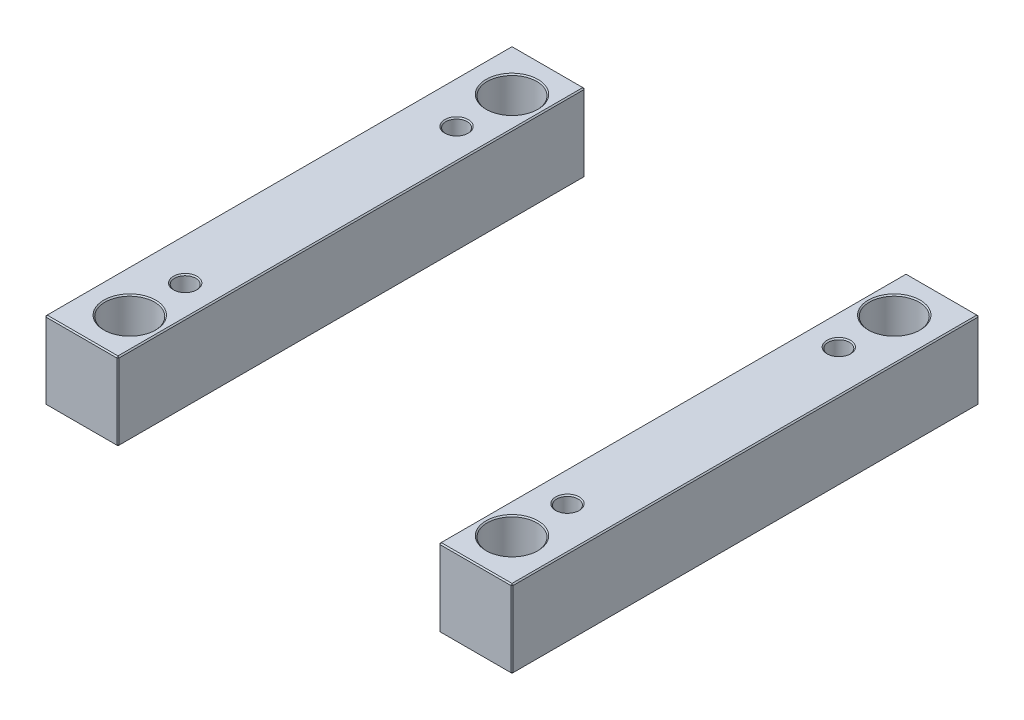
ISO-10303-21;
HEADER;
FILE_DESCRIPTION(('STEP AP214'),'2;1');
FILE_NAME('part.step','',(''),(''),'','','');
FILE_SCHEMA(('AUTOMOTIVE_DESIGN { 1 0 10303 214 1 1 1 1 }'));
ENDSEC;
DATA;
#1=APPLICATION_CONTEXT('core data for automotive mechanical design processes');
#2=APPLICATION_PROTOCOL_DEFINITION('international standard','automotive_design',2000,#1);
#3=PRODUCT_CONTEXT('',#1,'mechanical');
#4=PRODUCT('Part','Part','',(#3));
#5=PRODUCT_RELATED_PRODUCT_CATEGORY('part','',(#4));
#6=PRODUCT_DEFINITION_FORMATION('','',#4);
#7=PRODUCT_DEFINITION_CONTEXT('part definition',#1,'design');
#8=PRODUCT_DEFINITION('design','',#6,#7);
#9=PRODUCT_DEFINITION_SHAPE('','',#8);
#10=(LENGTH_UNIT() NAMED_UNIT(*) SI_UNIT(.MILLI.,.METRE.));
#11=(NAMED_UNIT(*) PLANE_ANGLE_UNIT() SI_UNIT($,.RADIAN.));
#12=(NAMED_UNIT(*) SI_UNIT($,.STERADIAN.) SOLID_ANGLE_UNIT());
#13=UNCERTAINTY_MEASURE_WITH_UNIT(LENGTH_MEASURE(1.E-05),#10,'distance_accuracy_value','');
#14=(GEOMETRIC_REPRESENTATION_CONTEXT(3) GLOBAL_UNCERTAINTY_ASSIGNED_CONTEXT((#13)) GLOBAL_UNIT_ASSIGNED_CONTEXT((#10,
#11,#12)) REPRESENTATION_CONTEXT('',''));
#15=CARTESIAN_POINT('',(0.,0.,0.));
#16=DIRECTION('',(0.,0.,1.));
#17=DIRECTION('',(1.,0.,0.));
#18=AXIS2_PLACEMENT_3D('',#15,#16,#17);
#19=CARTESIAN_POINT('',(-198.,66.,-198.));
#20=DIRECTION('',(0.,0.,1.));
#21=DIRECTION('',(1.,0.,0.));
#22=AXIS2_PLACEMENT_3D('',#19,#20,#21);
#23=PLANE('',#22);
#24=DIRECTION('',(-1.,0.,0.));
#25=VECTOR('',#24,1.);
#26=CARTESIAN_POINT('',(-198.,1.,-198.));
#27=LINE('',#26,#25);
#28=CARTESIAN_POINT('',(-137.,1.,-198.));
#29=VERTEX_POINT('',#28);
#30=CARTESIAN_POINT('',(-197.,1.,-198.));
#31=VERTEX_POINT('',#30);
#32=EDGE_CURVE('P0_E137',#29,#31,#27,.T.);
#33=ORIENTED_EDGE('',*,*,#32,.T.);
#34=DIRECTION('',(0.,1.,0.));
#35=VECTOR('',#34,1.);
#36=CARTESIAN_POINT('',(-197.,66.,-198.));
#37=LINE('',#36,#35);
#38=CARTESIAN_POINT('',(-197.,65.,-198.));
#39=VERTEX_POINT('',#38);
#40=EDGE_CURVE('P0_E265',#31,#39,#37,.T.);
#41=ORIENTED_EDGE('',*,*,#40,.T.);
#42=DIRECTION('',(1.,0.,0.));
#43=VECTOR('',#42,1.);
#44=CARTESIAN_POINT('',(-198.,65.,-198.));
#45=LINE('',#44,#43);
#46=CARTESIAN_POINT('',(-137.,65.,-198.));
#47=VERTEX_POINT('',#46);
#48=EDGE_CURVE('P0_E263',#39,#47,#45,.T.);
#49=ORIENTED_EDGE('',*,*,#48,.T.);
#50=DIRECTION('',(0.,-1.,0.));
#51=VECTOR('',#50,1.);
#52=CARTESIAN_POINT('',(-137.,66.,-198.));
#53=LINE('',#52,#51);
#54=EDGE_CURVE('P0_E260',#47,#29,#53,.T.);
#55=ORIENTED_EDGE('',*,*,#54,.T.);
#56=EDGE_LOOP('',(#33,#41,#49,#55));
#57=FACE_BOUND('',#56,.T.);
#58=ADVANCED_FACE('P0_F16',(#57),#23,.F.);
#59=CARTESIAN_POINT('',(-198.,66.,198.));
#60=DIRECTION('',(1.,0.,0.));
#61=DIRECTION('',(0.,0.,-1.));
#62=AXIS2_PLACEMENT_3D('',#59,#60,#61);
#63=PLANE('',#62);
#64=DIRECTION('',(0.,1.,0.));
#65=VECTOR('',#64,1.);
#66=CARTESIAN_POINT('',(-198.,66.,197.));
#67=LINE('',#66,#65);
#68=CARTESIAN_POINT('',(-198.,1.,197.));
#69=VERTEX_POINT('',#68);
#70=CARTESIAN_POINT('',(-198.,65.,197.));
#71=VERTEX_POINT('',#70);
#72=EDGE_CURVE('P0_E253',#69,#71,#67,.T.);
#73=ORIENTED_EDGE('',*,*,#72,.T.);
#74=DIRECTION('',(0.,0.,-1.));
#75=VECTOR('',#74,1.);
#76=CARTESIAN_POINT('',(-198.,65.,198.));
#77=LINE('',#76,#75);
#78=CARTESIAN_POINT('',(-198.,65.,-197.));
#79=VERTEX_POINT('',#78);
#80=EDGE_CURVE('P0_E258',#71,#79,#77,.T.);
#81=ORIENTED_EDGE('',*,*,#80,.T.);
#82=DIRECTION('',(0.,-1.,0.));
#83=VECTOR('',#82,1.);
#84=CARTESIAN_POINT('',(-198.,66.,-197.));
#85=LINE('',#84,#83);
#86=CARTESIAN_POINT('',(-198.,1.,-197.));
#87=VERTEX_POINT('',#86);
#88=EDGE_CURVE('P0_E255',#79,#87,#85,.T.);
#89=ORIENTED_EDGE('',*,*,#88,.T.);
#90=DIRECTION('',(0.,0.,1.));
#91=VECTOR('',#90,1.);
#92=CARTESIAN_POINT('',(-198.,1.,198.));
#93=LINE('',#92,#91);
#94=EDGE_CURVE('P0_E251',#87,#69,#93,.T.);
#95=ORIENTED_EDGE('',*,*,#94,.T.);
#96=EDGE_LOOP('',(#73,#81,#89,#95));
#97=FACE_BOUND('',#96,.T.);
#98=ADVANCED_FACE('P0_F333',(#97),#63,.F.);
#99=CARTESIAN_POINT('',(-198.,66.,198.));
#100=DIRECTION('',(0.,0.,-1.));
#101=DIRECTION('',(-1.,0.,0.));
#102=AXIS2_PLACEMENT_3D('',#99,#100,#101);
#103=PLANE('',#102);
#104=DIRECTION('',(-1.,0.,0.));
#105=VECTOR('',#104,1.);
#106=CARTESIAN_POINT('',(-198.,65.,198.));
#107=LINE('',#106,#105);
#108=CARTESIAN_POINT('',(-137.,65.,198.));
#109=VERTEX_POINT('',#108);
#110=CARTESIAN_POINT('',(-197.,65.,198.));
#111=VERTEX_POINT('',#110);
#112=EDGE_CURVE('P0_E272',#109,#111,#107,.T.);
#113=ORIENTED_EDGE('',*,*,#112,.T.);
#114=DIRECTION('',(0.,-1.,0.));
#115=VECTOR('',#114,1.);
#116=CARTESIAN_POINT('',(-197.,66.,198.));
#117=LINE('',#116,#115);
#118=CARTESIAN_POINT('',(-197.,1.,198.));
#119=VERTEX_POINT('',#118);
#120=EDGE_CURVE('P0_E274',#111,#119,#117,.T.);
#121=ORIENTED_EDGE('',*,*,#120,.T.);
#122=DIRECTION('',(1.,0.,0.));
#123=VECTOR('',#122,1.);
#124=CARTESIAN_POINT('',(-136.,1.,198.));
#125=LINE('',#124,#123);
#126=CARTESIAN_POINT('',(-137.,1.,198.));
#127=VERTEX_POINT('',#126);
#128=EDGE_CURVE('P0_E270',#119,#127,#125,.T.);
#129=ORIENTED_EDGE('',*,*,#128,.T.);
#130=DIRECTION('',(0.,1.,0.));
#131=VECTOR('',#130,1.);
#132=CARTESIAN_POINT('',(-137.,66.,198.));
#133=LINE('',#132,#131);
#134=EDGE_CURVE('P0_E268',#127,#109,#133,.T.);
#135=ORIENTED_EDGE('',*,*,#134,.T.);
#136=EDGE_LOOP('',(#113,#121,#129,#135));
#137=FACE_BOUND('',#136,.T.);
#138=ADVANCED_FACE('P0_F372',(#137),#103,.F.);
#139=CARTESIAN_POINT('',(-136.,66.,-198.));
#140=DIRECTION('',(-1.,0.,0.));
#141=DIRECTION('',(0.,0.,1.));
#142=AXIS2_PLACEMENT_3D('',#139,#140,#141);
#143=PLANE('',#142);
#144=DIRECTION('',(0.,0.,1.));
#145=VECTOR('',#144,1.);
#146=CARTESIAN_POINT('',(-136.,65.,-198.));
#147=LINE('',#146,#145);
#148=CARTESIAN_POINT('',(-136.,65.,-197.));
#149=VERTEX_POINT('',#148);
#150=CARTESIAN_POINT('',(-136.,65.,197.));
#151=VERTEX_POINT('',#150);
#152=EDGE_CURVE('P0_E31',#149,#151,#147,.T.);
#153=ORIENTED_EDGE('',*,*,#152,.T.);
#154=DIRECTION('',(0.,-1.,0.));
#155=VECTOR('',#154,1.);
#156=CARTESIAN_POINT('',(-136.,66.,197.));
#157=LINE('',#156,#155);
#158=CARTESIAN_POINT('',(-136.,1.,197.));
#159=VERTEX_POINT('',#158);
#160=EDGE_CURVE('P0_E190',#151,#159,#157,.T.);
#161=ORIENTED_EDGE('',*,*,#160,.T.);
#162=DIRECTION('',(0.,0.,-1.));
#163=VECTOR('',#162,1.);
#164=CARTESIAN_POINT('',(-136.,1.,-198.));
#165=LINE('',#164,#163);
#166=CARTESIAN_POINT('',(-136.,1.,-197.));
#167=VERTEX_POINT('',#166);
#168=EDGE_CURVE('P0_E286',#159,#167,#165,.T.);
#169=ORIENTED_EDGE('',*,*,#168,.T.);
#170=DIRECTION('',(0.,1.,0.));
#171=VECTOR('',#170,1.);
#172=CARTESIAN_POINT('',(-136.,66.,-197.));
#173=LINE('',#172,#171);
#174=EDGE_CURVE('P0_E36',#167,#149,#173,.T.);
#175=ORIENTED_EDGE('',*,*,#174,.T.);
#176=EDGE_LOOP('',(#153,#161,#169,#175));
#177=FACE_BOUND('',#176,.T.);
#178=ADVANCED_FACE('P0_F649',(#177),#143,.F.);
#179=CARTESIAN_POINT('',(0.,66.,0.));
#180=DIRECTION('',(0.,-1.,0.));
#181=DIRECTION('',(0.,0.,-1.));
#182=AXIS2_PLACEMENT_3D('',#179,#180,#181);
#183=PLANE('',#182);
#184=CARTESIAN_POINT('',(-162.,66.,-162.));
#185=DIRECTION('',(0.,-1.,0.));
#186=DIRECTION('',(0.,0.,-1.));
#187=AXIS2_PLACEMENT_3D('',#184,#185,#186);
#188=CIRCLE('',#187,22.);
#189=CARTESIAN_POINT('',(-162.,66.,-184.));
#190=VERTEX_POINT('',#189);
#191=EDGE_CURVE('P0_E214',#190,#190,#188,.T.);
#192=ORIENTED_EDGE('',*,*,#191,.T.);
#193=EDGE_LOOP('',(#192));
#194=FACE_BOUND('',#193,.T.);
#195=CARTESIAN_POINT('',(-162.,66.,162.));
#196=DIRECTION('',(0.,-1.,0.));
#197=DIRECTION('',(0.,0.,-1.));
#198=AXIS2_PLACEMENT_3D('',#195,#196,#197);
#199=CIRCLE('',#198,22.);
#200=CARTESIAN_POINT('',(-162.,66.,140.));
#201=VERTEX_POINT('',#200);
#202=EDGE_CURVE('P0_E211',#201,#201,#199,.T.);
#203=ORIENTED_EDGE('',*,*,#202,.T.);
#204=EDGE_LOOP('',(#203));
#205=FACE_BOUND('',#204,.T.);
#206=CARTESIAN_POINT('',(-162.,66.,115.));
#207=DIRECTION('',(0.,-1.,0.));
#208=DIRECTION('',(0.,0.,-1.));
#209=AXIS2_PLACEMENT_3D('',#206,#207,#208);
#210=CIRCLE('',#209,10.);
#211=CARTESIAN_POINT('',(-162.,66.,105.));
#212=VERTEX_POINT('',#211);
#213=EDGE_CURVE('P0_E193',#212,#212,#210,.T.);
#214=ORIENTED_EDGE('',*,*,#213,.T.);
#215=EDGE_LOOP('',(#214));
#216=FACE_BOUND('',#215,.T.);
#217=CARTESIAN_POINT('',(-162.,66.,-115.));
#218=DIRECTION('',(0.,-1.,0.));
#219=DIRECTION('',(0.,0.,-1.));
#220=AXIS2_PLACEMENT_3D('',#217,#218,#219);
#221=CIRCLE('',#220,10.);
#222=CARTESIAN_POINT('',(-162.,66.,-125.));
#223=VERTEX_POINT('',#222);
#224=EDGE_CURVE('P0_E189',#223,#223,#221,.T.);
#225=ORIENTED_EDGE('',*,*,#224,.T.);
#226=EDGE_LOOP('',(#225));
#227=FACE_BOUND('',#226,.T.);
#228=DIRECTION('',(0.,0.,1.));
#229=VECTOR('',#228,1.);
#230=CARTESIAN_POINT('',(-197.,66.,0.));
#231=LINE('',#230,#229);
#232=CARTESIAN_POINT('',(-197.,66.,-197.));
#233=VERTEX_POINT('',#232);
#234=CARTESIAN_POINT('',(-197.,66.,197.));
#235=VERTEX_POINT('',#234);
#236=EDGE_CURVE('P0_E281',#233,#235,#231,.T.);
#237=ORIENTED_EDGE('',*,*,#236,.T.);
#238=DIRECTION('',(1.,0.,0.));
#239=VECTOR('',#238,1.);
#240=CARTESIAN_POINT('',(-1.76382206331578E-13,66.,197.));
#241=LINE('',#240,#239);
#242=CARTESIAN_POINT('',(-137.,66.,197.));
#243=VERTEX_POINT('',#242);
#244=EDGE_CURVE('P0_E283',#235,#243,#241,.T.);
#245=ORIENTED_EDGE('',*,*,#244,.T.);
#246=DIRECTION('',(0.,0.,-1.));
#247=VECTOR('',#246,1.);
#248=CARTESIAN_POINT('',(-137.,66.,0.));
#249=LINE('',#248,#247);
#250=CARTESIAN_POINT('',(-137.,66.,-197.));
#251=VERTEX_POINT('',#250);
#252=EDGE_CURVE('P0_E277',#243,#251,#249,.T.);
#253=ORIENTED_EDGE('',*,*,#252,.T.);
#254=DIRECTION('',(-1.,0.,0.));
#255=VECTOR('',#254,1.);
#256=CARTESIAN_POINT('',(1.76382206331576E-13,66.,-197.));
#257=LINE('',#256,#255);
#258=EDGE_CURVE('P0_E279',#251,#233,#257,.T.);
#259=ORIENTED_EDGE('',*,*,#258,.T.);
#260=EDGE_LOOP('',(#237,#245,#253,#259));
#261=FACE_BOUND('',#260,.T.);
#262=ADVANCED_FACE('P0_F229',(#194,#205,#216,#227,#261),#183,.F.);
#263=CARTESIAN_POINT('',(0.,0.,0.));
#264=DIRECTION('',(0.,-1.,0.));
#265=DIRECTION('',(0.,0.,-1.));
#266=AXIS2_PLACEMENT_3D('',#263,#264,#265);
#267=PLANE('',#266);
#268=CARTESIAN_POINT('',(-162.,0.,-162.));
#269=DIRECTION('',(0.,-1.,0.));
#270=DIRECTION('',(0.,0.,-1.));
#271=AXIS2_PLACEMENT_3D('',#268,#269,#270);
#272=CIRCLE('',#271,22.);
#273=CARTESIAN_POINT('',(-162.,0.,-184.));
#274=VERTEX_POINT('',#273);
#275=EDGE_CURVE('P0_E202',#274,#274,#272,.F.);
#276=ORIENTED_EDGE('',*,*,#275,.T.);
#277=EDGE_LOOP('',(#276));
#278=FACE_BOUND('',#277,.T.);
#279=CARTESIAN_POINT('',(-162.,0.,162.));
#280=DIRECTION('',(0.,-1.,0.));
#281=DIRECTION('',(0.,0.,-1.));
#282=AXIS2_PLACEMENT_3D('',#279,#280,#281);
#283=CIRCLE('',#282,22.);
#284=CARTESIAN_POINT('',(-162.,0.,140.));
#285=VERTEX_POINT('',#284);
#286=EDGE_CURVE('P0_E199',#285,#285,#283,.F.);
#287=ORIENTED_EDGE('',*,*,#286,.T.);
#288=EDGE_LOOP('',(#287));
#289=FACE_BOUND('',#288,.T.);
#290=CARTESIAN_POINT('',(-162.,0.,-115.));
#291=DIRECTION('',(0.,-1.,0.));
#292=DIRECTION('',(0.,0.,-1.));
#293=AXIS2_PLACEMENT_3D('',#290,#291,#292);
#294=CIRCLE('',#293,10.);
#295=CARTESIAN_POINT('',(-162.,0.,-125.));
#296=VERTEX_POINT('',#295);
#297=EDGE_CURVE('P0_E235',#296,#296,#294,.F.);
#298=ORIENTED_EDGE('',*,*,#297,.T.);
#299=EDGE_LOOP('',(#298));
#300=FACE_BOUND('',#299,.T.);
#301=CARTESIAN_POINT('',(-162.,0.,115.));
#302=DIRECTION('',(0.,-1.,0.));
#303=DIRECTION('',(0.,0.,-1.));
#304=AXIS2_PLACEMENT_3D('',#301,#302,#303);
#305=CIRCLE('',#304,10.);
#306=CARTESIAN_POINT('',(-162.,0.,105.));
#307=VERTEX_POINT('',#306);
#308=EDGE_CURVE('P0_E238',#307,#307,#305,.F.);
#309=ORIENTED_EDGE('',*,*,#308,.T.);
#310=EDGE_LOOP('',(#309));
#311=FACE_BOUND('',#310,.T.);
#312=DIRECTION('',(-1.,0.,0.));
#313=VECTOR('',#312,1.);
#314=CARTESIAN_POINT('',(-198.,0.,197.));
#315=LINE('',#314,#313);
#316=CARTESIAN_POINT('',(-137.,0.,197.));
#317=VERTEX_POINT('',#316);
#318=CARTESIAN_POINT('',(-197.,0.,197.));
#319=VERTEX_POINT('',#318);
#320=EDGE_CURVE('P0_E114',#317,#319,#315,.T.);
#321=ORIENTED_EDGE('',*,*,#320,.T.);
#322=DIRECTION('',(0.,0.,-1.));
#323=VECTOR('',#322,1.);
#324=CARTESIAN_POINT('',(-197.,0.,-198.));
#325=LINE('',#324,#323);
#326=CARTESIAN_POINT('',(-197.,0.,-197.));
#327=VERTEX_POINT('',#326);
#328=EDGE_CURVE('P0_E110',#319,#327,#325,.T.);
#329=ORIENTED_EDGE('',*,*,#328,.T.);
#330=DIRECTION('',(1.,0.,0.));
#331=VECTOR('',#330,1.);
#332=CARTESIAN_POINT('',(-136.,0.,-197.));
#333=LINE('',#332,#331);
#334=CARTESIAN_POINT('',(-137.,0.,-197.));
#335=VERTEX_POINT('',#334);
#336=EDGE_CURVE('P0_E104',#327,#335,#333,.T.);
#337=ORIENTED_EDGE('',*,*,#336,.T.);
#338=DIRECTION('',(0.,0.,1.));
#339=VECTOR('',#338,1.);
#340=CARTESIAN_POINT('',(-137.,0.,198.));
#341=LINE('',#340,#339);
#342=EDGE_CURVE('P0_E107',#335,#317,#341,.T.);
#343=ORIENTED_EDGE('',*,*,#342,.T.);
#344=EDGE_LOOP('',(#321,#329,#337,#343));
#345=FACE_BOUND('',#344,.T.);
#346=ADVANCED_FACE('P0_F106',(#278,#289,#300,#311,#345),#267,.T.);
#347=CARTESIAN_POINT('',(-162.,0.,-115.));
#348=DIRECTION('',(0.,1.,0.));
#349=DIRECTION('',(0.,0.,1.));
#350=AXIS2_PLACEMENT_3D('',#347,#348,#349);
#351=CYLINDRICAL_SURFACE('',#350,9.);
#352=CARTESIAN_POINT('',(-162.,65.,-115.));
#353=DIRECTION('',(0.,-1.,0.));
#354=DIRECTION('',(0.,0.,-1.));
#355=AXIS2_PLACEMENT_3D('',#352,#353,#354);
#356=CIRCLE('',#355,9.);
#357=CARTESIAN_POINT('',(-162.,65.,-124.));
#358=VERTEX_POINT('',#357);
#359=EDGE_CURVE('P0_E196',#358,#358,#356,.F.);
#360=ORIENTED_EDGE('',*,*,#359,.T.);
#361=EDGE_LOOP('',(#360));
#362=FACE_BOUND('',#361,.T.);
#363=CARTESIAN_POINT('',(-162.,0.999999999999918,-115.));
#364=DIRECTION('',(0.,-1.,0.));
#365=DIRECTION('',(0.,0.,-1.));
#366=AXIS2_PLACEMENT_3D('',#363,#364,#365);
#367=CIRCLE('',#366,9.);
#368=CARTESIAN_POINT('',(-162.,0.999999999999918,-124.));
#369=VERTEX_POINT('',#368);
#370=EDGE_CURVE('P0_E241',#369,#369,#367,.T.);
#371=ORIENTED_EDGE('',*,*,#370,.T.);
#372=EDGE_LOOP('',(#371));
#373=FACE_BOUND('',#372,.T.);
#374=ADVANCED_FACE('P0_F228',(#362,#373),#351,.F.);
#375=CARTESIAN_POINT('',(-162.,0.,115.));
#376=DIRECTION('',(0.,1.,0.));
#377=DIRECTION('',(0.,0.,1.));
#378=AXIS2_PLACEMENT_3D('',#375,#376,#377);
#379=CYLINDRICAL_SURFACE('',#378,9.);
#380=CARTESIAN_POINT('',(-162.,65.,115.));
#381=DIRECTION('',(0.,-1.,0.));
#382=DIRECTION('',(0.,0.,-1.));
#383=AXIS2_PLACEMENT_3D('',#380,#381,#382);
#384=CIRCLE('',#383,9.);
#385=CARTESIAN_POINT('',(-162.,65.,106.));
#386=VERTEX_POINT('',#385);
#387=EDGE_CURVE('P0_E186',#386,#386,#384,.F.);
#388=ORIENTED_EDGE('',*,*,#387,.T.);
#389=EDGE_LOOP('',(#388));
#390=FACE_BOUND('',#389,.T.);
#391=CARTESIAN_POINT('',(-162.,0.999999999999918,115.));
#392=DIRECTION('',(0.,-1.,0.));
#393=DIRECTION('',(0.,0.,-1.));
#394=AXIS2_PLACEMENT_3D('',#391,#392,#393);
#395=CIRCLE('',#394,9.);
#396=CARTESIAN_POINT('',(-162.,0.999999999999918,106.));
#397=VERTEX_POINT('',#396);
#398=EDGE_CURVE('P0_E248',#397,#397,#395,.T.);
#399=ORIENTED_EDGE('',*,*,#398,.T.);
#400=EDGE_LOOP('',(#399));
#401=FACE_BOUND('',#400,.T.);
#402=ADVANCED_FACE('P0_F380',(#390,#401),#379,.F.);
#403=CARTESIAN_POINT('',(-162.,0.,-115.));
#404=DIRECTION('',(0.,-1.,0.));
#405=DIRECTION('',(0.,0.,-1.));
#406=AXIS2_PLACEMENT_3D('',#403,#404,#405);
#407=CONICAL_SURFACE('',#406,10.,0.78539816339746);
#408=ORIENTED_EDGE('',*,*,#370,.F.);
#409=EDGE_LOOP('',(#408));
#410=FACE_BOUND('',#409,.T.);
#411=ORIENTED_EDGE('',*,*,#297,.F.);
#412=EDGE_LOOP('',(#411));
#413=FACE_BOUND('',#412,.T.);
#414=ADVANCED_FACE('P0_F376',(#410,#413),#407,.F.);
#415=CARTESIAN_POINT('',(-162.,0.,115.));
#416=DIRECTION('',(0.,-1.,0.));
#417=DIRECTION('',(0.,0.,-1.));
#418=AXIS2_PLACEMENT_3D('',#415,#416,#417);
#419=CONICAL_SURFACE('',#418,10.,0.78539816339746);
#420=ORIENTED_EDGE('',*,*,#398,.F.);
#421=EDGE_LOOP('',(#420));
#422=FACE_BOUND('',#421,.T.);
#423=ORIENTED_EDGE('',*,*,#308,.F.);
#424=EDGE_LOOP('',(#423));
#425=FACE_BOUND('',#424,.T.);
#426=ADVANCED_FACE('P0_F379',(#422,#425),#419,.F.);
#427=CARTESIAN_POINT('',(-136.,66.,197.));
#428=DIRECTION('',(-0.707106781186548,0.,-0.707106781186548));
#429=DIRECTION('',(0.,-1.,0.));
#430=AXIS2_PLACEMENT_3D('',#427,#428,#429);
#431=PLANE('',#430);
#432=DIRECTION('',(-0.707106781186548,0.,0.707106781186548));
#433=VECTOR('',#432,1.);
#434=CARTESIAN_POINT('',(-136.5,65.,197.5));
#435=LINE('',#434,#433);
#436=EDGE_CURVE('P0_E125',#109,#151,#435,.F.);
#437=ORIENTED_EDGE('',*,*,#436,.F.);
#438=ORIENTED_EDGE('',*,*,#134,.F.);
#439=DIRECTION('',(0.707106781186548,0.,-0.707106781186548));
#440=VECTOR('',#439,1.);
#441=CARTESIAN_POINT('',(-137.,1.,198.));
#442=LINE('',#441,#440);
#443=EDGE_CURVE('P0_E181',#159,#127,#442,.F.);
#444=ORIENTED_EDGE('',*,*,#443,.F.);
#445=ORIENTED_EDGE('',*,*,#160,.F.);
#446=EDGE_LOOP('',(#437,#438,#444,#445));
#447=FACE_BOUND('',#446,.T.);
#448=ADVANCED_FACE('P0_F384',(#447),#431,.F.);
#449=CARTESIAN_POINT('',(-137.,66.,197.));
#450=DIRECTION('',(0.577350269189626,0.577350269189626,0.577350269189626));
#451=DIRECTION('',(0.707106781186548,0.,-0.707106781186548));
#452=AXIS2_PLACEMENT_3D('',#449,#450,#451);
#453=PLANE('',#452);
#454=DIRECTION('',(0.,0.707106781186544,-0.707106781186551));
#455=VECTOR('',#454,1.);
#456=CARTESIAN_POINT('',(-137.,66.,197.));
#457=LINE('',#456,#455);
#458=EDGE_CURVE('P0_E175',#109,#243,#457,.T.);
#459=ORIENTED_EDGE('',*,*,#458,.F.);
#460=ORIENTED_EDGE('',*,*,#436,.T.);
#461=DIRECTION('',(0.707106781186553,-0.707106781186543,0.));
#462=VECTOR('',#461,1.);
#463=CARTESIAN_POINT('',(-137.,66.,197.));
#464=LINE('',#463,#462);
#465=EDGE_CURVE('P0_E178',#243,#151,#464,.T.);
#466=ORIENTED_EDGE('',*,*,#465,.F.);
#467=EDGE_LOOP('',(#459,#460,#466));
#468=FACE_BOUND('',#467,.T.);
#469=ADVANCED_FACE('P0_F588',(#468),#453,.T.);
#470=CARTESIAN_POINT('',(-137.,1.,198.));
#471=DIRECTION('',(0.57735026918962,-0.577350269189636,0.57735026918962));
#472=DIRECTION('',(0.,-0.707106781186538,-0.707106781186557));
#473=AXIS2_PLACEMENT_3D('',#470,#471,#472);
#474=PLANE('',#473);
#475=DIRECTION('',(0.707106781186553,0.707106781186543,0.));
#476=VECTOR('',#475,1.);
#477=CARTESIAN_POINT('',(-136.5,0.500000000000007,197.));
#478=LINE('',#477,#476);
#479=EDGE_CURVE('P0_E123',#159,#317,#478,.F.);
#480=ORIENTED_EDGE('',*,*,#479,.F.);
#481=ORIENTED_EDGE('',*,*,#443,.T.);
#482=DIRECTION('',(0.,-0.707106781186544,-0.707106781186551));
#483=VECTOR('',#482,1.);
#484=CARTESIAN_POINT('',(-137.,1.,198.));
#485=LINE('',#484,#483);
#486=EDGE_CURVE('P0_E172',#317,#127,#485,.F.);
#487=ORIENTED_EDGE('',*,*,#486,.F.);
#488=EDGE_LOOP('',(#480,#481,#487));
#489=FACE_BOUND('',#488,.T.);
#490=ADVANCED_FACE('P0_F597',(#489),#474,.T.);
#491=CARTESIAN_POINT('',(-137.,66.,0.));
#492=DIRECTION('',(-0.707106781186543,-0.707106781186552,0.));
#493=DIRECTION('',(0.,0.,-1.));
#494=AXIS2_PLACEMENT_3D('',#491,#492,#493);
#495=PLANE('',#494);
#496=ORIENTED_EDGE('',*,*,#465,.T.);
#497=ORIENTED_EDGE('',*,*,#152,.F.);
#498=DIRECTION('',(-0.707106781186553,0.707106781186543,0.));
#499=VECTOR('',#498,1.);
#500=CARTESIAN_POINT('',(-136.5,65.5,-197.));
#501=LINE('',#500,#499);
#502=EDGE_CURVE('P0_E165',#251,#149,#501,.F.);
#503=ORIENTED_EDGE('',*,*,#502,.F.);
#504=ORIENTED_EDGE('',*,*,#252,.F.);
#505=EDGE_LOOP('',(#496,#497,#503,#504));
#506=FACE_BOUND('',#505,.T.);
#507=ADVANCED_FACE('P0_F349',(#506),#495,.F.);
#508=CARTESIAN_POINT('',(-1.76382206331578E-13,66.,197.));
#509=DIRECTION('',(0.,-0.707106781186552,-0.707106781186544));
#510=DIRECTION('',(1.,0.,0.));
#511=AXIS2_PLACEMENT_3D('',#508,#509,#510);
#512=PLANE('',#511);
#513=ORIENTED_EDGE('',*,*,#458,.T.);
#514=ORIENTED_EDGE('',*,*,#244,.F.);
#515=DIRECTION('',(0.,-0.707106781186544,0.707106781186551));
#516=VECTOR('',#515,1.);
#517=CARTESIAN_POINT('',(-197.,65.5,197.5));
#518=LINE('',#517,#516);
#519=EDGE_CURVE('P0_E162',#111,#235,#518,.F.);
#520=ORIENTED_EDGE('',*,*,#519,.F.);
#521=ORIENTED_EDGE('',*,*,#112,.F.);
#522=EDGE_LOOP('',(#513,#514,#520,#521));
#523=FACE_BOUND('',#522,.T.);
#524=ADVANCED_FACE('P0_F344',(#523),#512,.F.);
#525=CARTESIAN_POINT('',(-197.,66.,198.));
#526=DIRECTION('',(0.707106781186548,0.,-0.707106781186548));
#527=DIRECTION('',(0.,-1.,0.));
#528=AXIS2_PLACEMENT_3D('',#525,#526,#527);
#529=PLANE('',#528);
#530=DIRECTION('',(0.707106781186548,0.,0.707106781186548));
#531=VECTOR('',#530,1.);
#532=CARTESIAN_POINT('',(-197.,1.,198.));
#533=LINE('',#532,#531);
#534=EDGE_CURVE('P0_E156',#119,#69,#533,.F.);
#535=ORIENTED_EDGE('',*,*,#534,.F.);
#536=ORIENTED_EDGE('',*,*,#120,.F.);
#537=DIRECTION('',(-0.707106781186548,0.,-0.707106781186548));
#538=VECTOR('',#537,1.);
#539=CARTESIAN_POINT('',(-198.,65.,197.));
#540=LINE('',#539,#538);
#541=EDGE_CURVE('P0_E159',#71,#111,#540,.F.);
#542=ORIENTED_EDGE('',*,*,#541,.F.);
#543=ORIENTED_EDGE('',*,*,#72,.F.);
#544=EDGE_LOOP('',(#535,#536,#542,#543));
#545=FACE_BOUND('',#544,.T.);
#546=ADVANCED_FACE('P0_F338',(#545),#529,.F.);
#547=CARTESIAN_POINT('',(-198.,1.,198.));
#548=DIRECTION('',(0.,-0.707106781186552,0.707106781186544));
#549=DIRECTION('',(-1.,0.,0.));
#550=AXIS2_PLACEMENT_3D('',#547,#548,#549);
#551=PLANE('',#550);
#552=ORIENTED_EDGE('',*,*,#486,.T.);
#553=ORIENTED_EDGE('',*,*,#128,.F.);
#554=DIRECTION('',(0.,0.707106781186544,0.707106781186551));
#555=VECTOR('',#554,1.);
#556=CARTESIAN_POINT('',(-197.,1.,198.));
#557=LINE('',#556,#555);
#558=EDGE_CURVE('P0_E134',#319,#119,#557,.T.);
#559=ORIENTED_EDGE('',*,*,#558,.F.);
#560=ORIENTED_EDGE('',*,*,#320,.F.);
#561=EDGE_LOOP('',(#552,#553,#559,#560));
#562=FACE_BOUND('',#561,.T.);
#563=ADVANCED_FACE('P0_F364',(#562),#551,.T.);
#564=CARTESIAN_POINT('',(-136.,1.,-198.));
#565=DIRECTION('',(0.707106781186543,-0.707106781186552,0.));
#566=DIRECTION('',(0.,0.,1.));
#567=AXIS2_PLACEMENT_3D('',#564,#565,#566);
#568=PLANE('',#567);
#569=ORIENTED_EDGE('',*,*,#479,.T.);
#570=ORIENTED_EDGE('',*,*,#342,.F.);
#571=DIRECTION('',(-0.707106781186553,-0.707106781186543,0.));
#572=VECTOR('',#571,1.);
#573=CARTESIAN_POINT('',(-137.,0.,-197.));
#574=LINE('',#573,#572);
#575=EDGE_CURVE('P0_E120',#167,#335,#574,.T.);
#576=ORIENTED_EDGE('',*,*,#575,.F.);
#577=ORIENTED_EDGE('',*,*,#168,.F.);
#578=EDGE_LOOP('',(#569,#570,#576,#577));
#579=FACE_BOUND('',#578,.T.);
#580=ADVANCED_FACE('P0_F119',(#579),#568,.T.);
#581=CARTESIAN_POINT('',(-137.,66.,-198.));
#582=DIRECTION('',(-0.707106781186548,0.,0.707106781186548));
#583=DIRECTION('',(0.,-1.,0.));
#584=AXIS2_PLACEMENT_3D('',#581,#582,#583);
#585=PLANE('',#584);
#586=DIRECTION('',(0.707106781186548,0.,0.707106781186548));
#587=VECTOR('',#586,1.);
#588=CARTESIAN_POINT('',(-137.,65.,-198.));
#589=LINE('',#588,#587);
#590=EDGE_CURVE('P0_E168',#149,#47,#589,.F.);
#591=ORIENTED_EDGE('',*,*,#590,.F.);
#592=ORIENTED_EDGE('',*,*,#174,.F.);
#593=DIRECTION('',(-0.707106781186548,0.,-0.707106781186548));
#594=VECTOR('',#593,1.);
#595=CARTESIAN_POINT('',(-136.5,1.,-197.5));
#596=LINE('',#595,#594);
#597=EDGE_CURVE('P0_E133',#29,#167,#596,.F.);
#598=ORIENTED_EDGE('',*,*,#597,.F.);
#599=ORIENTED_EDGE('',*,*,#54,.F.);
#600=EDGE_LOOP('',(#591,#592,#598,#599));
#601=FACE_BOUND('',#600,.T.);
#602=ADVANCED_FACE('P0_F354',(#601),#585,.F.);
#603=CARTESIAN_POINT('',(-137.,65.,-198.));
#604=DIRECTION('',(0.577350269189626,0.577350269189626,-0.577350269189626));
#605=DIRECTION('',(-0.707106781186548,0.,-0.707106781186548));
#606=AXIS2_PLACEMENT_3D('',#603,#604,#605);
#607=PLANE('',#606);
#608=ORIENTED_EDGE('',*,*,#502,.T.);
#609=ORIENTED_EDGE('',*,*,#590,.T.);
#610=DIRECTION('',(0.,-0.707106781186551,-0.707106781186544));
#611=VECTOR('',#610,1.);
#612=CARTESIAN_POINT('',(-137.,65.,-198.));
#613=LINE('',#612,#611);
#614=EDGE_CURVE('P0_E151',#251,#47,#613,.T.);
#615=ORIENTED_EDGE('',*,*,#614,.F.);
#616=EDGE_LOOP('',(#608,#609,#615));
#617=FACE_BOUND('',#616,.T.);
#618=ADVANCED_FACE('P0_F352',(#617),#607,.T.);
#619=CARTESIAN_POINT('',(-198.,65.,197.));
#620=DIRECTION('',(-0.577350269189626,0.577350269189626,0.577350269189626));
#621=DIRECTION('',(0.707106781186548,0.,0.707106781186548));
#622=AXIS2_PLACEMENT_3D('',#619,#620,#621);
#623=PLANE('',#622);
#624=ORIENTED_EDGE('',*,*,#541,.T.);
#625=ORIENTED_EDGE('',*,*,#519,.T.);
#626=DIRECTION('',(0.707106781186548,0.707106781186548,0.));
#627=VECTOR('',#626,1.);
#628=CARTESIAN_POINT('',(-198.,65.,197.));
#629=LINE('',#628,#627);
#630=EDGE_CURVE('P0_E142',#71,#235,#629,.T.);
#631=ORIENTED_EDGE('',*,*,#630,.F.);
#632=EDGE_LOOP('',(#624,#625,#631));
#633=FACE_BOUND('',#632,.T.);
#634=ADVANCED_FACE('P0_F341',(#633),#623,.T.);
#635=CARTESIAN_POINT('',(-197.,1.,198.));
#636=DIRECTION('',(-0.577350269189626,-0.577350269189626,0.577350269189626));
#637=DIRECTION('',(0.707106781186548,0.,0.707106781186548));
#638=AXIS2_PLACEMENT_3D('',#635,#636,#637);
#639=PLANE('',#638);
#640=ORIENTED_EDGE('',*,*,#558,.T.);
#641=ORIENTED_EDGE('',*,*,#534,.T.);
#642=DIRECTION('',(0.707106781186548,-0.707106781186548,0.));
#643=VECTOR('',#642,1.);
#644=CARTESIAN_POINT('',(-197.5,0.5,197.));
#645=LINE('',#644,#643);
#646=EDGE_CURVE('P0_E138',#319,#69,#645,.F.);
#647=ORIENTED_EDGE('',*,*,#646,.F.);
#648=EDGE_LOOP('',(#640,#641,#647));
#649=FACE_BOUND('',#648,.T.);
#650=ADVANCED_FACE('P0_F403',(#649),#639,.T.);
#651=CARTESIAN_POINT('',(-137.,0.,-197.));
#652=DIRECTION('',(0.57735026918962,-0.577350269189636,-0.57735026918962));
#653=DIRECTION('',(0.,0.707106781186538,-0.707106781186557));
#654=AXIS2_PLACEMENT_3D('',#651,#652,#653);
#655=PLANE('',#654);
#656=ORIENTED_EDGE('',*,*,#597,.T.);
#657=ORIENTED_EDGE('',*,*,#575,.T.);
#658=DIRECTION('',(0.,0.707106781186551,-0.707106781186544));
#659=VECTOR('',#658,1.);
#660=CARTESIAN_POINT('',(-137.,0.,-197.));
#661=LINE('',#660,#659);
#662=EDGE_CURVE('P0_E130',#29,#335,#661,.F.);
#663=ORIENTED_EDGE('',*,*,#662,.F.);
#664=EDGE_LOOP('',(#656,#657,#663));
#665=FACE_BOUND('',#664,.T.);
#666=ADVANCED_FACE('P0_F129',(#665),#655,.T.);
#667=CARTESIAN_POINT('',(1.76382206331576E-13,66.,-197.));
#668=DIRECTION('',(0.,-0.707106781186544,0.707106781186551));
#669=DIRECTION('',(-1.,0.,0.));
#670=AXIS2_PLACEMENT_3D('',#667,#668,#669);
#671=PLANE('',#670);
#672=ORIENTED_EDGE('',*,*,#614,.T.);
#673=ORIENTED_EDGE('',*,*,#48,.F.);
#674=DIRECTION('',(0.,0.707106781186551,0.707106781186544));
#675=VECTOR('',#674,1.);
#676=CARTESIAN_POINT('',(-197.,65.,-198.));
#677=LINE('',#676,#675);
#678=EDGE_CURVE('P0_E139',#233,#39,#677,.F.);
#679=ORIENTED_EDGE('',*,*,#678,.F.);
#680=ORIENTED_EDGE('',*,*,#258,.F.);
#681=EDGE_LOOP('',(#672,#673,#679,#680));
#682=FACE_BOUND('',#681,.T.);
#683=ADVANCED_FACE('P0_F316',(#682),#671,.F.);
#684=CARTESIAN_POINT('',(-197.,66.,0.));
#685=DIRECTION('',(0.707106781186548,-0.707106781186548,0.));
#686=DIRECTION('',(0.,0.,1.));
#687=AXIS2_PLACEMENT_3D('',#684,#685,#686);
#688=PLANE('',#687);
#689=ORIENTED_EDGE('',*,*,#630,.T.);
#690=ORIENTED_EDGE('',*,*,#236,.F.);
#691=DIRECTION('',(-0.707106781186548,-0.707106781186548,0.));
#692=VECTOR('',#691,1.);
#693=CARTESIAN_POINT('',(-197.5,65.5,-197.));
#694=LINE('',#693,#692);
#695=EDGE_CURVE('P0_E145',#79,#233,#694,.F.);
#696=ORIENTED_EDGE('',*,*,#695,.F.);
#697=ORIENTED_EDGE('',*,*,#80,.F.);
#698=EDGE_LOOP('',(#689,#690,#696,#697));
#699=FACE_BOUND('',#698,.T.);
#700=ADVANCED_FACE('P0_F310',(#699),#688,.F.);
#701=CARTESIAN_POINT('',(-198.,1.,198.));
#702=DIRECTION('',(-0.707106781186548,-0.707106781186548,0.));
#703=DIRECTION('',(0.,0.,-1.));
#704=AXIS2_PLACEMENT_3D('',#701,#702,#703);
#705=PLANE('',#704);
#706=ORIENTED_EDGE('',*,*,#646,.T.);
#707=ORIENTED_EDGE('',*,*,#94,.F.);
#708=DIRECTION('',(-0.707106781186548,0.707106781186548,0.));
#709=VECTOR('',#708,1.);
#710=CARTESIAN_POINT('',(-198.,1.,-197.));
#711=LINE('',#710,#709);
#712=EDGE_CURVE('P0_E297',#327,#87,#711,.T.);
#713=ORIENTED_EDGE('',*,*,#712,.F.);
#714=ORIENTED_EDGE('',*,*,#328,.F.);
#715=EDGE_LOOP('',(#706,#707,#713,#714));
#716=FACE_BOUND('',#715,.T.);
#717=ADVANCED_FACE('P0_F329',(#716),#705,.T.);
#718=CARTESIAN_POINT('',(-198.,1.,-198.));
#719=DIRECTION('',(0.,-0.707106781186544,-0.707106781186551));
#720=DIRECTION('',(1.,0.,0.));
#721=AXIS2_PLACEMENT_3D('',#718,#719,#720);
#722=PLANE('',#721);
#723=ORIENTED_EDGE('',*,*,#662,.T.);
#724=ORIENTED_EDGE('',*,*,#336,.F.);
#725=DIRECTION('',(0.,-0.707106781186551,0.707106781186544));
#726=VECTOR('',#725,1.);
#727=CARTESIAN_POINT('',(-197.,0.500000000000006,-197.5));
#728=LINE('',#727,#726);
#729=EDGE_CURVE('P0_E295',#31,#327,#728,.T.);
#730=ORIENTED_EDGE('',*,*,#729,.F.);
#731=ORIENTED_EDGE('',*,*,#32,.F.);
#732=EDGE_LOOP('',(#723,#724,#730,#731));
#733=FACE_BOUND('',#732,.T.);
#734=ADVANCED_FACE('P0_F136',(#733),#722,.T.);
#735=CARTESIAN_POINT('',(-197.,65.,-198.));
#736=DIRECTION('',(-0.577350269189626,0.577350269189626,-0.577350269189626));
#737=DIRECTION('',(-0.707106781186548,0.,0.707106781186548));
#738=AXIS2_PLACEMENT_3D('',#735,#736,#737);
#739=PLANE('',#738);
#740=ORIENTED_EDGE('',*,*,#695,.T.);
#741=ORIENTED_EDGE('',*,*,#678,.T.);
#742=DIRECTION('',(0.707106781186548,0.,-0.707106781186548));
#743=VECTOR('',#742,1.);
#744=CARTESIAN_POINT('',(-197.,65.,-198.));
#745=LINE('',#744,#743);
#746=EDGE_CURVE('P0_E293',#79,#39,#745,.T.);
#747=ORIENTED_EDGE('',*,*,#746,.F.);
#748=EDGE_LOOP('',(#740,#741,#747));
#749=FACE_BOUND('',#748,.T.);
#750=ADVANCED_FACE('P0_F303',(#749),#739,.T.);
#751=CARTESIAN_POINT('',(-198.,1.,-197.));
#752=DIRECTION('',(-0.577350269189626,-0.577350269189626,-0.577350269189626));
#753=DIRECTION('',(-0.707106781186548,0.,0.707106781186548));
#754=AXIS2_PLACEMENT_3D('',#751,#752,#753);
#755=PLANE('',#754);
#756=ORIENTED_EDGE('',*,*,#729,.T.);
#757=ORIENTED_EDGE('',*,*,#712,.T.);
#758=DIRECTION('',(-0.707106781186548,0.,0.707106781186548));
#759=VECTOR('',#758,1.);
#760=CARTESIAN_POINT('',(-198.,1.,-197.));
#761=LINE('',#760,#759);
#762=EDGE_CURVE('P0_E291',#31,#87,#761,.T.);
#763=ORIENTED_EDGE('',*,*,#762,.F.);
#764=EDGE_LOOP('',(#756,#757,#763));
#765=FACE_BOUND('',#764,.T.);
#766=ADVANCED_FACE('P0_F325',(#765),#755,.T.);
#767=CARTESIAN_POINT('',(-198.,66.,-197.));
#768=DIRECTION('',(0.707106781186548,0.,0.707106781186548));
#769=DIRECTION('',(0.,-1.,0.));
#770=AXIS2_PLACEMENT_3D('',#767,#768,#769);
#771=PLANE('',#770);
#772=ORIENTED_EDGE('',*,*,#746,.T.);
#773=ORIENTED_EDGE('',*,*,#40,.F.);
#774=ORIENTED_EDGE('',*,*,#762,.T.);
#775=ORIENTED_EDGE('',*,*,#88,.F.);
#776=EDGE_LOOP('',(#772,#773,#774,#775));
#777=FACE_BOUND('',#776,.T.);
#778=ADVANCED_FACE('P0_F323',(#777),#771,.F.);
#779=CARTESIAN_POINT('',(-162.,65.,115.));
#780=DIRECTION('',(0.,1.,0.));
#781=DIRECTION('',(0.,0.,1.));
#782=AXIS2_PLACEMENT_3D('',#779,#780,#781);
#783=CONICAL_SURFACE('',#782,9.,0.78539816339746);
#784=ORIENTED_EDGE('',*,*,#213,.F.);
#785=EDGE_LOOP('',(#784));
#786=FACE_BOUND('',#785,.T.);
#787=ORIENTED_EDGE('',*,*,#387,.F.);
#788=EDGE_LOOP('',(#787));
#789=FACE_BOUND('',#788,.T.);
#790=ADVANCED_FACE('P0_F388',(#786,#789),#783,.F.);
#791=CARTESIAN_POINT('',(-162.,65.,-115.));
#792=DIRECTION('',(0.,1.,0.));
#793=DIRECTION('',(0.,0.,1.));
#794=AXIS2_PLACEMENT_3D('',#791,#792,#793);
#795=CONICAL_SURFACE('',#794,9.,0.785398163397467);
#796=ORIENTED_EDGE('',*,*,#224,.F.);
#797=EDGE_LOOP('',(#796));
#798=FACE_BOUND('',#797,.T.);
#799=ORIENTED_EDGE('',*,*,#359,.F.);
#800=EDGE_LOOP('',(#799));
#801=FACE_BOUND('',#800,.T.);
#802=ADVANCED_FACE('P0_F470',(#798,#801),#795,.F.);
#803=CARTESIAN_POINT('',(-162.,0.,162.));
#804=DIRECTION('',(0.,1.,0.));
#805=DIRECTION('',(0.,0.,1.));
#806=AXIS2_PLACEMENT_3D('',#803,#804,#805);
#807=CYLINDRICAL_SURFACE('',#806,21.);
#808=CARTESIAN_POINT('',(-162.,65.,162.));
#809=DIRECTION('',(0.,-1.,0.));
#810=DIRECTION('',(0.,0.,-1.));
#811=AXIS2_PLACEMENT_3D('',#808,#809,#810);
#812=CIRCLE('',#811,21.);
#813=CARTESIAN_POINT('',(-162.,65.,141.));
#814=VERTEX_POINT('',#813);
#815=EDGE_CURVE('P0_E10',#814,#814,#812,.F.);
#816=ORIENTED_EDGE('',*,*,#815,.T.);
#817=EDGE_LOOP('',(#816));
#818=FACE_BOUND('',#817,.T.);
#819=CARTESIAN_POINT('',(-162.,0.999999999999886,162.));
#820=DIRECTION('',(0.,-1.,0.));
#821=DIRECTION('',(0.,0.,-1.));
#822=AXIS2_PLACEMENT_3D('',#819,#820,#821);
#823=CIRCLE('',#822,21.);
#824=CARTESIAN_POINT('',(-162.,0.999999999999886,141.));
#825=VERTEX_POINT('',#824);
#826=EDGE_CURVE('P0_E24',#825,#825,#823,.T.);
#827=ORIENTED_EDGE('',*,*,#826,.T.);
#828=EDGE_LOOP('',(#827));
#829=FACE_BOUND('',#828,.T.);
#830=ADVANCED_FACE('P0_F219',(#818,#829),#807,.F.);
#831=CARTESIAN_POINT('',(-162.,0.,-162.));
#832=DIRECTION('',(0.,1.,0.));
#833=DIRECTION('',(0.,0.,1.));
#834=AXIS2_PLACEMENT_3D('',#831,#832,#833);
#835=CYLINDRICAL_SURFACE('',#834,21.);
#836=CARTESIAN_POINT('',(-162.,1.00000000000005,-162.));
#837=DIRECTION('',(0.,-1.,0.));
#838=DIRECTION('',(0.,0.,-1.));
#839=AXIS2_PLACEMENT_3D('',#836,#837,#838);
#840=CIRCLE('',#839,21.);
#841=CARTESIAN_POINT('',(-162.,1.00000000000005,-183.));
#842=VERTEX_POINT('',#841);
#843=EDGE_CURVE('P0_E208',#842,#842,#840,.T.);
#844=ORIENTED_EDGE('',*,*,#843,.T.);
#845=EDGE_LOOP('',(#844));
#846=FACE_BOUND('',#845,.T.);
#847=CARTESIAN_POINT('',(-162.,65.,-162.));
#848=DIRECTION('',(0.,-1.,0.));
#849=DIRECTION('',(0.,0.,-1.));
#850=AXIS2_PLACEMENT_3D('',#847,#848,#849);
#851=CIRCLE('',#850,21.);
#852=CARTESIAN_POINT('',(-162.,65.,-183.));
#853=VERTEX_POINT('',#852);
#854=EDGE_CURVE('P0_E205',#853,#853,#851,.F.);
#855=ORIENTED_EDGE('',*,*,#854,.T.);
#856=EDGE_LOOP('',(#855));
#857=FACE_BOUND('',#856,.T.);
#858=ADVANCED_FACE('P0_F487',(#846,#857),#835,.F.);
#859=CARTESIAN_POINT('',(-162.,0.,-162.));
#860=DIRECTION('',(0.,-1.,0.));
#861=DIRECTION('',(0.,0.,-1.));
#862=AXIS2_PLACEMENT_3D('',#859,#860,#861);
#863=CONICAL_SURFACE('',#862,22.,0.785398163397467);
#864=ORIENTED_EDGE('',*,*,#843,.F.);
#865=EDGE_LOOP('',(#864));
#866=FACE_BOUND('',#865,.T.);
#867=ORIENTED_EDGE('',*,*,#275,.F.);
#868=EDGE_LOOP('',(#867));
#869=FACE_BOUND('',#868,.T.);
#870=ADVANCED_FACE('P0_F496',(#866,#869),#863,.F.);
#871=CARTESIAN_POINT('',(-162.,65.,-162.));
#872=DIRECTION('',(0.,1.,0.));
#873=DIRECTION('',(0.,0.,1.));
#874=AXIS2_PLACEMENT_3D('',#871,#872,#873);
#875=CONICAL_SURFACE('',#874,21.,0.785398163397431);
#876=ORIENTED_EDGE('',*,*,#191,.F.);
#877=EDGE_LOOP('',(#876));
#878=FACE_BOUND('',#877,.T.);
#879=ORIENTED_EDGE('',*,*,#854,.F.);
#880=EDGE_LOOP('',(#879));
#881=FACE_BOUND('',#880,.T.);
#882=ADVANCED_FACE('P0_F505',(#878,#881),#875,.F.);
#883=CARTESIAN_POINT('',(-162.,65.,162.));
#884=DIRECTION('',(0.,1.,0.));
#885=DIRECTION('',(0.,0.,1.));
#886=AXIS2_PLACEMENT_3D('',#883,#884,#885);
#887=CONICAL_SURFACE('',#886,21.,0.785398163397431);
#888=ORIENTED_EDGE('',*,*,#202,.F.);
#889=EDGE_LOOP('',(#888));
#890=FACE_BOUND('',#889,.T.);
#891=ORIENTED_EDGE('',*,*,#815,.F.);
#892=EDGE_LOOP('',(#891));
#893=FACE_BOUND('',#892,.T.);
#894=ADVANCED_FACE('P0_F223',(#890,#893),#887,.F.);
#895=CARTESIAN_POINT('',(-162.,0.,162.));
#896=DIRECTION('',(0.,-1.,0.));
#897=DIRECTION('',(0.,0.,-1.));
#898=AXIS2_PLACEMENT_3D('',#895,#896,#897);
#899=CONICAL_SURFACE('',#898,22.,0.785398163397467);
#900=ORIENTED_EDGE('',*,*,#826,.F.);
#901=EDGE_LOOP('',(#900));
#902=FACE_BOUND('',#901,.T.);
#903=ORIENTED_EDGE('',*,*,#286,.F.);
#904=EDGE_LOOP('',(#903));
#905=FACE_BOUND('',#904,.T.);
#906=ADVANCED_FACE('P0_F18',(#902,#905),#899,.F.);
#907=CLOSED_SHELL('',(#58,#98,#138,#178,#262,#346,#374,#402,#414,#426,#448,#469,#490,#507,#524,
#546,#563,#580,#602,#618,#634,#650,#666,#683,#700,#717,#734,#750,#766,#778,#790,#802,#830,#858,
#870,#882,#894,#906));
#908=MANIFOLD_SOLID_BREP('P0_B1',#907);
#909=CARTESIAN_POINT('',(198.,66.,198.));
#910=DIRECTION('',(0.,0.,-1.));
#911=DIRECTION('',(-1.,0.,0.));
#912=AXIS2_PLACEMENT_3D('',#909,#910,#911);
#913=PLANE('',#912);
#914=DIRECTION('',(0.,-1.,0.));
#915=VECTOR('',#914,1.);
#916=CARTESIAN_POINT('',(137.,66.,198.));
#917=LINE('',#916,#915);
#918=CARTESIAN_POINT('',(137.,65.,198.));
#919=VERTEX_POINT('',#918);
#920=CARTESIAN_POINT('',(137.,1.,198.));
#921=VERTEX_POINT('',#920);
#922=EDGE_CURVE('P1_E175',#919,#921,#917,.T.);
#923=ORIENTED_EDGE('',*,*,#922,.T.);
#924=DIRECTION('',(1.,0.,0.));
#925=VECTOR('',#924,1.);
#926=CARTESIAN_POINT('',(198.,1.,198.));
#927=LINE('',#926,#925);
#928=CARTESIAN_POINT('',(197.,1.,198.));
#929=VERTEX_POINT('',#928);
#930=EDGE_CURVE('P1_E177',#921,#929,#927,.T.);
#931=ORIENTED_EDGE('',*,*,#930,.T.);
#932=DIRECTION('',(0.,1.,0.));
#933=VECTOR('',#932,1.);
#934=CARTESIAN_POINT('',(197.,66.,198.));
#935=LINE('',#934,#933);
#936=CARTESIAN_POINT('',(197.,65.,198.));
#937=VERTEX_POINT('',#936);
#938=EDGE_CURVE('P1_E173',#929,#937,#935,.T.);
#939=ORIENTED_EDGE('',*,*,#938,.T.);
#940=DIRECTION('',(-1.,0.,0.));
#941=VECTOR('',#940,1.);
#942=CARTESIAN_POINT('',(136.,65.,198.));
#943=LINE('',#942,#941);
#944=EDGE_CURVE('P1_E171',#937,#919,#943,.T.);
#945=ORIENTED_EDGE('',*,*,#944,.T.);
#946=EDGE_LOOP('',(#923,#931,#939,#945));
#947=FACE_BOUND('',#946,.T.);
#948=ADVANCED_FACE('P1_F17',(#947),#913,.F.);
#949=CARTESIAN_POINT('',(198.,66.,198.));
#950=DIRECTION('',(-1.,0.,0.));
#951=DIRECTION('',(0.,0.,1.));
#952=AXIS2_PLACEMENT_3D('',#949,#950,#951);
#953=PLANE('',#952);
#954=DIRECTION('',(0.,0.,1.));
#955=VECTOR('',#954,1.);
#956=CARTESIAN_POINT('',(198.,65.,198.));
#957=LINE('',#956,#955);
#958=CARTESIAN_POINT('',(198.,65.,-197.));
#959=VERTEX_POINT('',#958);
#960=CARTESIAN_POINT('',(198.,65.,197.));
#961=VERTEX_POINT('',#960);
#962=EDGE_CURVE('P1_E189',#959,#961,#957,.T.);
#963=ORIENTED_EDGE('',*,*,#962,.T.);
#964=DIRECTION('',(0.,-1.,0.));
#965=VECTOR('',#964,1.);
#966=CARTESIAN_POINT('',(198.,66.,197.));
#967=LINE('',#966,#965);
#968=CARTESIAN_POINT('',(198.,1.,197.));
#969=VERTEX_POINT('',#968);
#970=EDGE_CURVE('P1_E195',#961,#969,#967,.T.);
#971=ORIENTED_EDGE('',*,*,#970,.T.);
#972=DIRECTION('',(0.,0.,-1.));
#973=VECTOR('',#972,1.);
#974=CARTESIAN_POINT('',(198.,1.,198.));
#975=LINE('',#974,#973);
#976=CARTESIAN_POINT('',(198.,1.,-197.));
#977=VERTEX_POINT('',#976);
#978=EDGE_CURVE('P1_E193',#969,#977,#975,.T.);
#979=ORIENTED_EDGE('',*,*,#978,.T.);
#980=DIRECTION('',(0.,1.,0.));
#981=VECTOR('',#980,1.);
#982=CARTESIAN_POINT('',(198.,66.,-197.));
#983=LINE('',#982,#981);
#984=EDGE_CURVE('P1_E191',#977,#959,#983,.T.);
#985=ORIENTED_EDGE('',*,*,#984,.T.);
#986=EDGE_LOOP('',(#963,#971,#979,#985));
#987=FACE_BOUND('',#986,.T.);
#988=ADVANCED_FACE('P1_F322',(#987),#953,.F.);
#989=CARTESIAN_POINT('',(198.,66.,-198.));
#990=DIRECTION('',(0.,0.,1.));
#991=DIRECTION('',(1.,0.,0.));
#992=AXIS2_PLACEMENT_3D('',#989,#990,#991);
#993=PLANE('',#992);
#994=DIRECTION('',(0.,-1.,0.));
#995=VECTOR('',#994,1.);
#996=CARTESIAN_POINT('',(197.,66.,-198.));
#997=LINE('',#996,#995);
#998=CARTESIAN_POINT('',(197.,65.,-198.));
#999=VERTEX_POINT('',#998);
#1000=CARTESIAN_POINT('',(197.,1.,-198.));
#1001=VERTEX_POINT('',#1000);
#1002=EDGE_CURVE('P1_E166',#999,#1001,#997,.T.);
#1003=ORIENTED_EDGE('',*,*,#1002,.T.);
#1004=DIRECTION('',(-1.,0.,0.));
#1005=VECTOR('',#1004,1.);
#1006=CARTESIAN_POINT('',(198.,1.,-198.));
#1007=LINE('',#1006,#1005);
#1008=CARTESIAN_POINT('',(137.,1.,-198.));
#1009=VERTEX_POINT('',#1008);
#1010=EDGE_CURVE('P1_E113',#1001,#1009,#1007,.T.);
#1011=ORIENTED_EDGE('',*,*,#1010,.T.);
#1012=DIRECTION('',(0.,1.,0.));
#1013=VECTOR('',#1012,1.);
#1014=CARTESIAN_POINT('',(137.,66.,-198.));
#1015=LINE('',#1014,#1013);
#1016=CARTESIAN_POINT('',(137.,65.,-198.));
#1017=VERTEX_POINT('',#1016);
#1018=EDGE_CURVE('P1_E168',#1009,#1017,#1015,.T.);
#1019=ORIENTED_EDGE('',*,*,#1018,.T.);
#1020=DIRECTION('',(1.,0.,0.));
#1021=VECTOR('',#1020,1.);
#1022=CARTESIAN_POINT('',(198.,65.,-198.));
#1023=LINE('',#1022,#1021);
#1024=EDGE_CURVE('P1_E164',#1017,#999,#1023,.T.);
#1025=ORIENTED_EDGE('',*,*,#1024,.T.);
#1026=EDGE_LOOP('',(#1003,#1011,#1019,#1025));
#1027=FACE_BOUND('',#1026,.T.);
#1028=ADVANCED_FACE('P1_F329',(#1027),#993,.F.);
#1029=CARTESIAN_POINT('',(136.,66.,-198.));
#1030=DIRECTION('',(1.,0.,0.));
#1031=DIRECTION('',(0.,0.,-1.));
#1032=AXIS2_PLACEMENT_3D('',#1029,#1030,#1031);
#1033=PLANE('',#1032);
#1034=DIRECTION('',(0.,0.,-1.));
#1035=VECTOR('',#1034,1.);
#1036=CARTESIAN_POINT('',(136.,65.,-198.));
#1037=LINE('',#1036,#1035);
#1038=CARTESIAN_POINT('',(136.,65.,197.));
#1039=VERTEX_POINT('',#1038);
#1040=CARTESIAN_POINT('',(136.,65.,-197.));
#1041=VERTEX_POINT('',#1040);
#1042=EDGE_CURVE('P1_E180',#1039,#1041,#1037,.T.);
#1043=ORIENTED_EDGE('',*,*,#1042,.T.);
#1044=DIRECTION('',(0.,-1.,0.));
#1045=VECTOR('',#1044,1.);
#1046=CARTESIAN_POINT('',(136.,66.,-197.));
#1047=LINE('',#1046,#1045);
#1048=CARTESIAN_POINT('',(136.,1.,-197.));
#1049=VERTEX_POINT('',#1048);
#1050=EDGE_CURVE('P1_E186',#1041,#1049,#1047,.T.);
#1051=ORIENTED_EDGE('',*,*,#1050,.T.);
#1052=DIRECTION('',(0.,0.,1.));
#1053=VECTOR('',#1052,1.);
#1054=CARTESIAN_POINT('',(136.,1.,-198.));
#1055=LINE('',#1054,#1053);
#1056=CARTESIAN_POINT('',(136.,1.,197.));
#1057=VERTEX_POINT('',#1056);
#1058=EDGE_CURVE('P1_E184',#1049,#1057,#1055,.T.);
#1059=ORIENTED_EDGE('',*,*,#1058,.T.);
#1060=DIRECTION('',(0.,1.,0.));
#1061=VECTOR('',#1060,1.);
#1062=CARTESIAN_POINT('',(136.,66.,197.));
#1063=LINE('',#1062,#1061);
#1064=EDGE_CURVE('P1_E182',#1057,#1039,#1063,.T.);
#1065=ORIENTED_EDGE('',*,*,#1064,.T.);
#1066=EDGE_LOOP('',(#1043,#1051,#1059,#1065));
#1067=FACE_BOUND('',#1066,.T.);
#1068=ADVANCED_FACE('P1_F335',(#1067),#1033,.F.);
#1069=CARTESIAN_POINT('',(0.,66.,0.));
#1070=DIRECTION('',(0.,1.,0.));
#1071=DIRECTION('',(0.,0.,1.));
#1072=AXIS2_PLACEMENT_3D('',#1069,#1070,#1071);
#1073=PLANE('',#1072);
#1074=CARTESIAN_POINT('',(162.,66.,162.));
#1075=DIRECTION('',(0.,1.,0.));
#1076=DIRECTION('',(0.,0.,1.));
#1077=AXIS2_PLACEMENT_3D('',#1074,#1075,#1076);
#1078=CIRCLE('',#1077,22.);
#1079=CARTESIAN_POINT('',(162.,66.,184.));
#1080=VERTEX_POINT('',#1079);
#1081=EDGE_CURVE('P1_E273',#1080,#1080,#1078,.F.);
#1082=ORIENTED_EDGE('',*,*,#1081,.T.);
#1083=EDGE_LOOP('',(#1082));
#1084=FACE_BOUND('',#1083,.T.);
#1085=CARTESIAN_POINT('',(162.,66.,-162.));
#1086=DIRECTION('',(0.,1.,0.));
#1087=DIRECTION('',(0.,0.,1.));
#1088=AXIS2_PLACEMENT_3D('',#1085,#1086,#1087);
#1089=CIRCLE('',#1088,22.);
#1090=CARTESIAN_POINT('',(162.,66.,-140.));
#1091=VERTEX_POINT('',#1090);
#1092=EDGE_CURVE('P1_E270',#1091,#1091,#1089,.F.);
#1093=ORIENTED_EDGE('',*,*,#1092,.T.);
#1094=EDGE_LOOP('',(#1093));
#1095=FACE_BOUND('',#1094,.T.);
#1096=DIRECTION('',(-1.,0.,0.));
#1097=VECTOR('',#1096,1.);
#1098=CARTESIAN_POINT('',(136.,66.,-197.));
#1099=LINE('',#1098,#1097);
#1100=CARTESIAN_POINT('',(197.,66.,-197.));
#1101=VERTEX_POINT('',#1100);
#1102=CARTESIAN_POINT('',(137.,66.,-197.));
#1103=VERTEX_POINT('',#1102);
#1104=EDGE_CURVE('P1_E32',#1101,#1103,#1099,.T.);
#1105=ORIENTED_EDGE('',*,*,#1104,.T.);
#1106=DIRECTION('',(0.,0.,1.));
#1107=VECTOR('',#1106,1.);
#1108=CARTESIAN_POINT('',(137.,66.,198.));
#1109=LINE('',#1108,#1107);
#1110=CARTESIAN_POINT('',(137.,66.,197.));
#1111=VERTEX_POINT('',#1110);
#1112=EDGE_CURVE('P1_E208',#1103,#1111,#1109,.T.);
#1113=ORIENTED_EDGE('',*,*,#1112,.T.);
#1114=DIRECTION('',(1.,0.,0.));
#1115=VECTOR('',#1114,1.);
#1116=CARTESIAN_POINT('',(198.,66.,197.));
#1117=LINE('',#1116,#1115);
#1118=CARTESIAN_POINT('',(197.,66.,197.));
#1119=VERTEX_POINT('',#1118);
#1120=EDGE_CURVE('P1_E204',#1111,#1119,#1117,.T.);
#1121=ORIENTED_EDGE('',*,*,#1120,.T.);
#1122=DIRECTION('',(0.,0.,-1.));
#1123=VECTOR('',#1122,1.);
#1124=CARTESIAN_POINT('',(197.,66.,-198.));
#1125=LINE('',#1124,#1123);
#1126=EDGE_CURVE('P1_E37',#1119,#1101,#1125,.T.);
#1127=ORIENTED_EDGE('',*,*,#1126,.T.);
#1128=EDGE_LOOP('',(#1105,#1113,#1121,#1127));
#1129=FACE_BOUND('',#1128,.T.);
#1130=CARTESIAN_POINT('',(162.,66.,-115.));
#1131=DIRECTION('',(0.,1.,0.));
#1132=DIRECTION('',(0.,0.,1.));
#1133=AXIS2_PLACEMENT_3D('',#1130,#1131,#1132);
#1134=CIRCLE('',#1133,10.);
#1135=CARTESIAN_POINT('',(162.,66.,-105.));
#1136=VERTEX_POINT('',#1135);
#1137=EDGE_CURVE('P1_E201',#1136,#1136,#1134,.F.);
#1138=ORIENTED_EDGE('',*,*,#1137,.T.);
#1139=EDGE_LOOP('',(#1138));
#1140=FACE_BOUND('',#1139,.T.);
#1141=CARTESIAN_POINT('',(162.,66.,115.));
#1142=DIRECTION('',(0.,1.,0.));
#1143=DIRECTION('',(0.,0.,1.));
#1144=AXIS2_PLACEMENT_3D('',#1141,#1142,#1143);
#1145=CIRCLE('',#1144,10.);
#1146=CARTESIAN_POINT('',(162.,66.,125.));
#1147=VERTEX_POINT('',#1146);
#1148=EDGE_CURVE('P1_E198',#1147,#1147,#1145,.F.);
#1149=ORIENTED_EDGE('',*,*,#1148,.T.);
#1150=EDGE_LOOP('',(#1149));
#1151=FACE_BOUND('',#1150,.T.);
#1152=ADVANCED_FACE('P1_F294',(#1084,#1095,#1129,#1140,#1151),#1073,.T.);
#1153=CARTESIAN_POINT('',(0.,0.,0.));
#1154=DIRECTION('',(0.,1.,0.));
#1155=DIRECTION('',(0.,0.,1.));
#1156=AXIS2_PLACEMENT_3D('',#1153,#1154,#1155);
#1157=PLANE('',#1156);
#1158=CARTESIAN_POINT('',(162.,0.,162.));
#1159=DIRECTION('',(0.,1.,0.));
#1160=DIRECTION('',(0.,0.,1.));
#1161=AXIS2_PLACEMENT_3D('',#1158,#1159,#1160);
#1162=CIRCLE('',#1161,22.);
#1163=CARTESIAN_POINT('',(162.,0.,184.));
#1164=VERTEX_POINT('',#1163);
#1165=EDGE_CURVE('P1_E279',#1164,#1164,#1162,.T.);
#1166=ORIENTED_EDGE('',*,*,#1165,.T.);
#1167=EDGE_LOOP('',(#1166));
#1168=FACE_BOUND('',#1167,.T.);
#1169=CARTESIAN_POINT('',(162.,0.,-162.));
#1170=DIRECTION('',(0.,1.,0.));
#1171=DIRECTION('',(0.,0.,1.));
#1172=AXIS2_PLACEMENT_3D('',#1169,#1170,#1171);
#1173=CIRCLE('',#1172,22.);
#1174=CARTESIAN_POINT('',(162.,0.,-140.));
#1175=VERTEX_POINT('',#1174);
#1176=EDGE_CURVE('P1_E276',#1175,#1175,#1173,.T.);
#1177=ORIENTED_EDGE('',*,*,#1176,.T.);
#1178=EDGE_LOOP('',(#1177));
#1179=FACE_BOUND('',#1178,.T.);
#1180=CARTESIAN_POINT('',(162.,0.,-115.));
#1181=DIRECTION('',(0.,1.,0.));
#1182=DIRECTION('',(0.,0.,1.));
#1183=AXIS2_PLACEMENT_3D('',#1180,#1181,#1182);
#1184=CIRCLE('',#1183,10.);
#1185=CARTESIAN_POINT('',(162.,0.,-105.));
#1186=VERTEX_POINT('',#1185);
#1187=EDGE_CURVE('P1_E149',#1186,#1186,#1184,.T.);
#1188=ORIENTED_EDGE('',*,*,#1187,.T.);
#1189=EDGE_LOOP('',(#1188));
#1190=FACE_BOUND('',#1189,.T.);
#1191=CARTESIAN_POINT('',(162.,0.,115.));
#1192=DIRECTION('',(0.,1.,0.));
#1193=DIRECTION('',(0.,0.,1.));
#1194=AXIS2_PLACEMENT_3D('',#1191,#1192,#1193);
#1195=CIRCLE('',#1194,10.);
#1196=CARTESIAN_POINT('',(162.,0.,125.));
#1197=VERTEX_POINT('',#1196);
#1198=EDGE_CURVE('P1_E143',#1197,#1197,#1195,.T.);
#1199=ORIENTED_EDGE('',*,*,#1198,.T.);
#1200=EDGE_LOOP('',(#1199));
#1201=FACE_BOUND('',#1200,.T.);
#1202=DIRECTION('',(-1.,0.,0.));
#1203=VECTOR('',#1202,1.);
#1204=CARTESIAN_POINT('',(2.64573309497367E-13,0.,197.));
#1205=LINE('',#1204,#1203);
#1206=CARTESIAN_POINT('',(197.,0.,197.));
#1207=VERTEX_POINT('',#1206);
#1208=CARTESIAN_POINT('',(137.,0.,197.));
#1209=VERTEX_POINT('',#1208);
#1210=EDGE_CURVE('P1_E135',#1207,#1209,#1205,.T.);
#1211=ORIENTED_EDGE('',*,*,#1210,.T.);
#1212=DIRECTION('',(0.,0.,-1.));
#1213=VECTOR('',#1212,1.);
#1214=CARTESIAN_POINT('',(137.,0.,0.));
#1215=LINE('',#1214,#1213);
#1216=CARTESIAN_POINT('',(137.,0.,-197.));
#1217=VERTEX_POINT('',#1216);
#1218=EDGE_CURVE('P1_E140',#1209,#1217,#1215,.T.);
#1219=ORIENTED_EDGE('',*,*,#1218,.T.);
#1220=DIRECTION('',(1.,0.,0.));
#1221=VECTOR('',#1220,1.);
#1222=CARTESIAN_POINT('',(-7.93719928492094E-13,0.,-197.));
#1223=LINE('',#1222,#1221);
#1224=CARTESIAN_POINT('',(197.,0.,-197.));
#1225=VERTEX_POINT('',#1224);
#1226=EDGE_CURVE('P1_E110',#1217,#1225,#1223,.T.);
#1227=ORIENTED_EDGE('',*,*,#1226,.T.);
#1228=DIRECTION('',(0.,0.,1.));
#1229=VECTOR('',#1228,1.);
#1230=CARTESIAN_POINT('',(197.,0.,0.));
#1231=LINE('',#1230,#1229);
#1232=EDGE_CURVE('P1_E129',#1225,#1207,#1231,.T.);
#1233=ORIENTED_EDGE('',*,*,#1232,.T.);
#1234=EDGE_LOOP('',(#1211,#1219,#1227,#1233));
#1235=FACE_BOUND('',#1234,.T.);
#1236=ADVANCED_FACE('P1_F138',(#1168,#1179,#1190,#1201,#1235),#1157,.F.);
#1237=CARTESIAN_POINT('',(162.,0.,-115.));
#1238=DIRECTION('',(0.,1.,0.));
#1239=DIRECTION('',(0.,0.,1.));
#1240=AXIS2_PLACEMENT_3D('',#1237,#1238,#1239);
#1241=CYLINDRICAL_SURFACE('',#1240,9.);
#1242=CARTESIAN_POINT('',(162.,0.999999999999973,-115.));
#1243=DIRECTION('',(0.,1.,0.));
#1244=DIRECTION('',(0.,0.,1.));
#1245=AXIS2_PLACEMENT_3D('',#1242,#1243,#1244);
#1246=CIRCLE('',#1245,9.);
#1247=CARTESIAN_POINT('',(162.,0.999999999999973,-106.));
#1248=VERTEX_POINT('',#1247);
#1249=EDGE_CURVE('P1_E155',#1248,#1248,#1246,.F.);
#1250=ORIENTED_EDGE('',*,*,#1249,.T.);
#1251=EDGE_LOOP('',(#1250));
#1252=FACE_BOUND('',#1251,.T.);
#1253=CARTESIAN_POINT('',(162.,65.,-115.));
#1254=DIRECTION('',(0.,1.,0.));
#1255=DIRECTION('',(0.,0.,1.));
#1256=AXIS2_PLACEMENT_3D('',#1253,#1254,#1255);
#1257=CIRCLE('',#1256,9.);
#1258=CARTESIAN_POINT('',(162.,65.,-106.));
#1259=VERTEX_POINT('',#1258);
#1260=EDGE_CURVE('P1_E152',#1259,#1259,#1257,.T.);
#1261=ORIENTED_EDGE('',*,*,#1260,.T.);
#1262=EDGE_LOOP('',(#1261));
#1263=FACE_BOUND('',#1262,.T.);
#1264=ADVANCED_FACE('P1_F293',(#1252,#1263),#1241,.F.);
#1265=CARTESIAN_POINT('',(162.,0.,115.));
#1266=DIRECTION('',(0.,1.,0.));
#1267=DIRECTION('',(0.,0.,1.));
#1268=AXIS2_PLACEMENT_3D('',#1265,#1266,#1267);
#1269=CYLINDRICAL_SURFACE('',#1268,9.);
#1270=CARTESIAN_POINT('',(162.,0.999999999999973,115.));
#1271=DIRECTION('',(0.,1.,0.));
#1272=DIRECTION('',(0.,0.,1.));
#1273=AXIS2_PLACEMENT_3D('',#1270,#1271,#1272);
#1274=CIRCLE('',#1273,9.);
#1275=CARTESIAN_POINT('',(162.,0.999999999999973,124.));
#1276=VERTEX_POINT('',#1275);
#1277=EDGE_CURVE('P1_E161',#1276,#1276,#1274,.F.);
#1278=ORIENTED_EDGE('',*,*,#1277,.T.);
#1279=EDGE_LOOP('',(#1278));
#1280=FACE_BOUND('',#1279,.T.);
#1281=CARTESIAN_POINT('',(162.,65.,115.));
#1282=DIRECTION('',(0.,1.,0.));
#1283=DIRECTION('',(0.,0.,1.));
#1284=AXIS2_PLACEMENT_3D('',#1281,#1282,#1283);
#1285=CIRCLE('',#1284,9.);
#1286=CARTESIAN_POINT('',(162.,65.,124.));
#1287=VERTEX_POINT('',#1286);
#1288=EDGE_CURVE('P1_E158',#1287,#1287,#1285,.T.);
#1289=ORIENTED_EDGE('',*,*,#1288,.T.);
#1290=EDGE_LOOP('',(#1289));
#1291=FACE_BOUND('',#1290,.T.);
#1292=ADVANCED_FACE('P1_F316',(#1280,#1291),#1269,.F.);
#1293=CARTESIAN_POINT('',(162.,0.,-115.));
#1294=DIRECTION('',(0.,-1.,0.));
#1295=DIRECTION('',(0.,0.,-1.));
#1296=AXIS2_PLACEMENT_3D('',#1293,#1294,#1295);
#1297=CONICAL_SURFACE('',#1296,10.,0.785398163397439);
#1298=ORIENTED_EDGE('',*,*,#1249,.F.);
#1299=EDGE_LOOP('',(#1298));
#1300=FACE_BOUND('',#1299,.T.);
#1301=ORIENTED_EDGE('',*,*,#1187,.F.);
#1302=EDGE_LOOP('',(#1301));
#1303=FACE_BOUND('',#1302,.T.);
#1304=ADVANCED_FACE('P1_F304',(#1300,#1303),#1297,.F.);
#1305=CARTESIAN_POINT('',(162.,0.,115.));
#1306=DIRECTION('',(0.,-1.,0.));
#1307=DIRECTION('',(0.,0.,-1.));
#1308=AXIS2_PLACEMENT_3D('',#1305,#1306,#1307);
#1309=CONICAL_SURFACE('',#1308,10.,0.785398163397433);
#1310=ORIENTED_EDGE('',*,*,#1277,.F.);
#1311=EDGE_LOOP('',(#1310));
#1312=FACE_BOUND('',#1311,.T.);
#1313=ORIENTED_EDGE('',*,*,#1198,.F.);
#1314=EDGE_LOOP('',(#1313));
#1315=FACE_BOUND('',#1314,.T.);
#1316=ADVANCED_FACE('P1_F301',(#1312,#1315),#1309,.F.);
#1317=CARTESIAN_POINT('',(2.64573309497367E-13,66.,197.));
#1318=DIRECTION('',(0.,0.707106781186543,0.707106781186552));
#1319=DIRECTION('',(-1.,0.,0.));
#1320=AXIS2_PLACEMENT_3D('',#1317,#1318,#1319);
#1321=PLANE('',#1320);
#1322=DIRECTION('',(0.,-0.707106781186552,0.707106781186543));
#1323=VECTOR('',#1322,1.);
#1324=CARTESIAN_POINT('',(197.,65.,198.));
#1325=LINE('',#1324,#1323);
#1326=EDGE_CURVE('P1_E136',#1119,#937,#1325,.T.);
#1327=ORIENTED_EDGE('',*,*,#1326,.F.);
#1328=ORIENTED_EDGE('',*,*,#1120,.F.);
#1329=DIRECTION('',(0.,0.707106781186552,-0.707106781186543));
#1330=VECTOR('',#1329,1.);
#1331=CARTESIAN_POINT('',(137.,65.5,197.5));
#1332=LINE('',#1331,#1330);
#1333=EDGE_CURVE('P1_E260',#919,#1111,#1332,.T.);
#1334=ORIENTED_EDGE('',*,*,#1333,.F.);
#1335=ORIENTED_EDGE('',*,*,#944,.F.);
#1336=EDGE_LOOP('',(#1327,#1328,#1334,#1335));
#1337=FACE_BOUND('',#1336,.T.);
#1338=ADVANCED_FACE('P1_F303',(#1337),#1321,.T.);
#1339=CARTESIAN_POINT('',(197.,65.,198.));
#1340=DIRECTION('',(0.577350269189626,0.577350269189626,0.577350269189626));
#1341=DIRECTION('',(0.707106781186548,0.,-0.707106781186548));
#1342=AXIS2_PLACEMENT_3D('',#1339,#1340,#1341);
#1343=PLANE('',#1342);
#1344=DIRECTION('',(-0.707106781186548,0.707106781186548,0.));
#1345=VECTOR('',#1344,1.);
#1346=CARTESIAN_POINT('',(197.5,65.5,197.));
#1347=LINE('',#1346,#1345);
#1348=EDGE_CURVE('P1_E254',#1119,#961,#1347,.F.);
#1349=ORIENTED_EDGE('',*,*,#1348,.F.);
#1350=ORIENTED_EDGE('',*,*,#1326,.T.);
#1351=DIRECTION('',(-0.707106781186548,0.,0.707106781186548));
#1352=VECTOR('',#1351,1.);
#1353=CARTESIAN_POINT('',(197.,65.,198.));
#1354=LINE('',#1353,#1352);
#1355=EDGE_CURVE('P1_E257',#961,#937,#1354,.T.);
#1356=ORIENTED_EDGE('',*,*,#1355,.F.);
#1357=EDGE_LOOP('',(#1349,#1350,#1356));
#1358=FACE_BOUND('',#1357,.T.);
#1359=ADVANCED_FACE('P1_F313',(#1358),#1343,.T.);
#1360=CARTESIAN_POINT('',(136.,65.,197.));
#1361=DIRECTION('',(-0.577350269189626,0.577350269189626,0.577350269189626));
#1362=DIRECTION('',(0.707106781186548,0.,0.707106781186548));
#1363=AXIS2_PLACEMENT_3D('',#1360,#1361,#1362);
#1364=PLANE('',#1363);
#1365=DIRECTION('',(-0.707106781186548,0.,-0.707106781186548));
#1366=VECTOR('',#1365,1.);
#1367=CARTESIAN_POINT('',(136.,65.,197.));
#1368=LINE('',#1367,#1366);
#1369=EDGE_CURVE('P1_E249',#919,#1039,#1368,.T.);
#1370=ORIENTED_EDGE('',*,*,#1369,.F.);
#1371=ORIENTED_EDGE('',*,*,#1333,.T.);
#1372=DIRECTION('',(-0.707106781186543,-0.707106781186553,0.));
#1373=VECTOR('',#1372,1.);
#1374=CARTESIAN_POINT('',(136.,65.,197.));
#1375=LINE('',#1374,#1373);
#1376=EDGE_CURVE('P1_E252',#1039,#1111,#1375,.F.);
#1377=ORIENTED_EDGE('',*,*,#1376,.F.);
#1378=EDGE_LOOP('',(#1370,#1371,#1377));
#1379=FACE_BOUND('',#1378,.T.);
#1380=ADVANCED_FACE('P1_F385',(#1379),#1364,.T.);
#1381=CARTESIAN_POINT('',(198.,66.,197.));
#1382=DIRECTION('',(-0.707106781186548,0.,-0.707106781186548));
#1383=DIRECTION('',(0.,-1.,0.));
#1384=AXIS2_PLACEMENT_3D('',#1381,#1382,#1383);
#1385=PLANE('',#1384);
#1386=ORIENTED_EDGE('',*,*,#1355,.T.);
#1387=ORIENTED_EDGE('',*,*,#938,.F.);
#1388=DIRECTION('',(0.707106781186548,0.,-0.707106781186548));
#1389=VECTOR('',#1388,1.);
#1390=CARTESIAN_POINT('',(197.,1.,198.));
#1391=LINE('',#1390,#1389);
#1392=EDGE_CURVE('P1_E244',#969,#929,#1391,.F.);
#1393=ORIENTED_EDGE('',*,*,#1392,.F.);
#1394=ORIENTED_EDGE('',*,*,#970,.F.);
#1395=EDGE_LOOP('',(#1386,#1387,#1393,#1394));
#1396=FACE_BOUND('',#1395,.T.);
#1397=ADVANCED_FACE('P1_F389',(#1396),#1385,.F.);
#1398=CARTESIAN_POINT('',(197.,66.,0.));
#1399=DIRECTION('',(0.707106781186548,0.707106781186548,0.));
#1400=DIRECTION('',(0.,0.,1.));
#1401=AXIS2_PLACEMENT_3D('',#1398,#1399,#1400);
#1402=PLANE('',#1401);
#1403=ORIENTED_EDGE('',*,*,#1348,.T.);
#1404=ORIENTED_EDGE('',*,*,#962,.F.);
#1405=DIRECTION('',(0.707106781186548,-0.707106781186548,0.));
#1406=VECTOR('',#1405,1.);
#1407=CARTESIAN_POINT('',(198.,65.,-197.));
#1408=LINE('',#1407,#1406);
#1409=EDGE_CURVE('P1_E241',#1101,#959,#1408,.T.);
#1410=ORIENTED_EDGE('',*,*,#1409,.F.);
#1411=ORIENTED_EDGE('',*,*,#1126,.F.);
#1412=EDGE_LOOP('',(#1403,#1404,#1410,#1411));
#1413=FACE_BOUND('',#1412,.T.);
#1414=ADVANCED_FACE('P1_F393',(#1413),#1402,.T.);
#1415=CARTESIAN_POINT('',(-7.93719928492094E-13,66.,-197.));
#1416=DIRECTION('',(0.,0.70710678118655,-0.707106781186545));
#1417=DIRECTION('',(1.,0.,0.));
#1418=AXIS2_PLACEMENT_3D('',#1415,#1416,#1417);
#1419=PLANE('',#1418);
#1420=DIRECTION('',(0.,-0.707106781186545,-0.70710678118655));
#1421=VECTOR('',#1420,1.);
#1422=CARTESIAN_POINT('',(137.,65.,-198.));
#1423=LINE('',#1422,#1421);
#1424=EDGE_CURVE('P1_E235',#1103,#1017,#1423,.T.);
#1425=ORIENTED_EDGE('',*,*,#1424,.F.);
#1426=ORIENTED_EDGE('',*,*,#1104,.F.);
#1427=DIRECTION('',(0.,0.707106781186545,0.70710678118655));
#1428=VECTOR('',#1427,1.);
#1429=CARTESIAN_POINT('',(197.,65.5,-197.5));
#1430=LINE('',#1429,#1428);
#1431=EDGE_CURVE('P1_E238',#999,#1101,#1430,.T.);
#1432=ORIENTED_EDGE('',*,*,#1431,.F.);
#1433=ORIENTED_EDGE('',*,*,#1024,.F.);
#1434=EDGE_LOOP('',(#1425,#1426,#1432,#1433));
#1435=FACE_BOUND('',#1434,.T.);
#1436=ADVANCED_FACE('P1_F397',(#1435),#1419,.T.);
#1437=CARTESIAN_POINT('',(137.,66.,0.));
#1438=DIRECTION('',(-0.707106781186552,0.707106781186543,0.));
#1439=DIRECTION('',(0.,0.,-1.));
#1440=AXIS2_PLACEMENT_3D('',#1437,#1438,#1439);
#1441=PLANE('',#1440);
#1442=ORIENTED_EDGE('',*,*,#1376,.T.);
#1443=ORIENTED_EDGE('',*,*,#1112,.F.);
#1444=DIRECTION('',(0.707106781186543,0.707106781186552,0.));
#1445=VECTOR('',#1444,1.);
#1446=CARTESIAN_POINT('',(136.5,65.5,-197.));
#1447=LINE('',#1446,#1445);
#1448=EDGE_CURVE('P1_E232',#1041,#1103,#1447,.T.);
#1449=ORIENTED_EDGE('',*,*,#1448,.F.);
#1450=ORIENTED_EDGE('',*,*,#1042,.F.);
#1451=EDGE_LOOP('',(#1442,#1443,#1449,#1450));
#1452=FACE_BOUND('',#1451,.T.);
#1453=ADVANCED_FACE('P1_F401',(#1452),#1441,.T.);
#1454=CARTESIAN_POINT('',(137.,66.,198.));
#1455=DIRECTION('',(0.707106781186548,0.,-0.707106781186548));
#1456=DIRECTION('',(0.,-1.,0.));
#1457=AXIS2_PLACEMENT_3D('',#1454,#1455,#1456);
#1458=PLANE('',#1457);
#1459=ORIENTED_EDGE('',*,*,#1369,.T.);
#1460=ORIENTED_EDGE('',*,*,#1064,.F.);
#1461=DIRECTION('',(0.707106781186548,0.,0.707106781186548));
#1462=VECTOR('',#1461,1.);
#1463=CARTESIAN_POINT('',(136.5,1.,197.5));
#1464=LINE('',#1463,#1462);
#1465=EDGE_CURVE('P1_E229',#921,#1057,#1464,.F.);
#1466=ORIENTED_EDGE('',*,*,#1465,.F.);
#1467=ORIENTED_EDGE('',*,*,#922,.F.);
#1468=EDGE_LOOP('',(#1459,#1460,#1466,#1467));
#1469=FACE_BOUND('',#1468,.T.);
#1470=ADVANCED_FACE('P1_F405',(#1469),#1458,.F.);
#1471=CARTESIAN_POINT('',(198.,1.,198.));
#1472=DIRECTION('',(0.,0.707106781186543,-0.707106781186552));
#1473=DIRECTION('',(1.,0.,0.));
#1474=AXIS2_PLACEMENT_3D('',#1471,#1472,#1473);
#1475=PLANE('',#1474);
#1476=DIRECTION('',(0.,0.707106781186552,0.707106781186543));
#1477=VECTOR('',#1476,1.);
#1478=CARTESIAN_POINT('',(197.,1.,198.));
#1479=LINE('',#1478,#1477);
#1480=EDGE_CURVE('P1_E246',#929,#1207,#1479,.F.);
#1481=ORIENTED_EDGE('',*,*,#1480,.F.);
#1482=ORIENTED_EDGE('',*,*,#930,.F.);
#1483=DIRECTION('',(0.,-0.707106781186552,-0.707106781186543));
#1484=VECTOR('',#1483,1.);
#1485=CARTESIAN_POINT('',(137.,0.,197.));
#1486=LINE('',#1485,#1484);
#1487=EDGE_CURVE('P1_E226',#1209,#921,#1486,.F.);
#1488=ORIENTED_EDGE('',*,*,#1487,.F.);
#1489=ORIENTED_EDGE('',*,*,#1210,.F.);
#1490=EDGE_LOOP('',(#1481,#1482,#1488,#1489));
#1491=FACE_BOUND('',#1490,.T.);
#1492=ADVANCED_FACE('P1_F409',(#1491),#1475,.F.);
#1493=CARTESIAN_POINT('',(197.,1.,198.));
#1494=DIRECTION('',(0.577350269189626,-0.577350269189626,0.577350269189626));
#1495=DIRECTION('',(0.707106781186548,0.,-0.707106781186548));
#1496=AXIS2_PLACEMENT_3D('',#1493,#1494,#1495);
#1497=PLANE('',#1496);
#1498=ORIENTED_EDGE('',*,*,#1392,.T.);
#1499=ORIENTED_EDGE('',*,*,#1480,.T.);
#1500=DIRECTION('',(-0.707106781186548,-0.707106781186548,0.));
#1501=VECTOR('',#1500,1.);
#1502=CARTESIAN_POINT('',(197.5,0.5,197.));
#1503=LINE('',#1502,#1501);
#1504=EDGE_CURVE('P1_E132',#969,#1207,#1503,.T.);
#1505=ORIENTED_EDGE('',*,*,#1504,.F.);
#1506=EDGE_LOOP('',(#1498,#1499,#1505));
#1507=FACE_BOUND('',#1506,.T.);
#1508=ADVANCED_FACE('P1_F413',(#1507),#1497,.T.);
#1509=CARTESIAN_POINT('',(198.,65.,-197.));
#1510=DIRECTION('',(0.577350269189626,0.577350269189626,-0.577350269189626));
#1511=DIRECTION('',(-0.707106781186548,0.,-0.707106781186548));
#1512=AXIS2_PLACEMENT_3D('',#1509,#1510,#1511);
#1513=PLANE('',#1512);
#1514=ORIENTED_EDGE('',*,*,#1431,.T.);
#1515=ORIENTED_EDGE('',*,*,#1409,.T.);
#1516=DIRECTION('',(0.707106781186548,0.,0.707106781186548));
#1517=VECTOR('',#1516,1.);
#1518=CARTESIAN_POINT('',(198.,65.,-197.));
#1519=LINE('',#1518,#1517);
#1520=EDGE_CURVE('P1_E222',#999,#959,#1519,.T.);
#1521=ORIENTED_EDGE('',*,*,#1520,.F.);
#1522=EDGE_LOOP('',(#1514,#1515,#1521));
#1523=FACE_BOUND('',#1522,.T.);
#1524=ADVANCED_FACE('P1_F417',(#1523),#1513,.T.);
#1525=CARTESIAN_POINT('',(137.,65.,-198.));
#1526=DIRECTION('',(-0.577350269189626,0.577350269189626,-0.577350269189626));
#1527=DIRECTION('',(-0.707106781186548,0.,0.707106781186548));
#1528=AXIS2_PLACEMENT_3D('',#1525,#1526,#1527);
#1529=PLANE('',#1528);
#1530=ORIENTED_EDGE('',*,*,#1448,.T.);
#1531=ORIENTED_EDGE('',*,*,#1424,.T.);
#1532=DIRECTION('',(0.707106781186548,0.,-0.707106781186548));
#1533=VECTOR('',#1532,1.);
#1534=CARTESIAN_POINT('',(137.,65.,-198.));
#1535=LINE('',#1534,#1533);
#1536=EDGE_CURVE('P1_E219',#1041,#1017,#1535,.T.);
#1537=ORIENTED_EDGE('',*,*,#1536,.F.);
#1538=EDGE_LOOP('',(#1530,#1531,#1537));
#1539=FACE_BOUND('',#1538,.T.);
#1540=ADVANCED_FACE('P1_F421',(#1539),#1529,.T.);
#1541=CARTESIAN_POINT('',(137.,0.,197.));
#1542=DIRECTION('',(-0.577350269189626,-0.577350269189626,0.577350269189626));
#1543=DIRECTION('',(0.707106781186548,0.,0.707106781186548));
#1544=AXIS2_PLACEMENT_3D('',#1541,#1542,#1543);
#1545=PLANE('',#1544);
#1546=ORIENTED_EDGE('',*,*,#1487,.T.);
#1547=ORIENTED_EDGE('',*,*,#1465,.T.);
#1548=DIRECTION('',(-0.707106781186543,0.707106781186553,0.));
#1549=VECTOR('',#1548,1.);
#1550=CARTESIAN_POINT('',(137.,0.,197.));
#1551=LINE('',#1550,#1549);
#1552=EDGE_CURVE('P1_E126',#1209,#1057,#1551,.T.);
#1553=ORIENTED_EDGE('',*,*,#1552,.F.);
#1554=EDGE_LOOP('',(#1546,#1547,#1553));
#1555=FACE_BOUND('',#1554,.T.);
#1556=ADVANCED_FACE('P1_F425',(#1555),#1545,.T.);
#1557=CARTESIAN_POINT('',(198.,1.,198.));
#1558=DIRECTION('',(-0.707106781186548,0.707106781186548,0.));
#1559=DIRECTION('',(0.,0.,-1.));
#1560=AXIS2_PLACEMENT_3D('',#1557,#1558,#1559);
#1561=PLANE('',#1560);
#1562=ORIENTED_EDGE('',*,*,#1504,.T.);
#1563=ORIENTED_EDGE('',*,*,#1232,.F.);
#1564=DIRECTION('',(0.707106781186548,0.707106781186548,0.));
#1565=VECTOR('',#1564,1.);
#1566=CARTESIAN_POINT('',(197.,0.,-197.));
#1567=LINE('',#1566,#1565);
#1568=EDGE_CURVE('P1_E120',#977,#1225,#1567,.F.);
#1569=ORIENTED_EDGE('',*,*,#1568,.F.);
#1570=ORIENTED_EDGE('',*,*,#978,.F.);
#1571=EDGE_LOOP('',(#1562,#1563,#1569,#1570));
#1572=FACE_BOUND('',#1571,.T.);
#1573=ADVANCED_FACE('P1_F130',(#1572),#1561,.F.);
#1574=CARTESIAN_POINT('',(197.,66.,-198.));
#1575=DIRECTION('',(-0.707106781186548,0.,0.707106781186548));
#1576=DIRECTION('',(0.,-1.,0.));
#1577=AXIS2_PLACEMENT_3D('',#1574,#1575,#1576);
#1578=PLANE('',#1577);
#1579=ORIENTED_EDGE('',*,*,#1520,.T.);
#1580=ORIENTED_EDGE('',*,*,#984,.F.);
#1581=DIRECTION('',(-0.707106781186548,0.,-0.707106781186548));
#1582=VECTOR('',#1581,1.);
#1583=CARTESIAN_POINT('',(197.5,1.,-197.5));
#1584=LINE('',#1583,#1582);
#1585=EDGE_CURVE('P1_E124',#1001,#977,#1584,.F.);
#1586=ORIENTED_EDGE('',*,*,#1585,.F.);
#1587=ORIENTED_EDGE('',*,*,#1002,.F.);
#1588=EDGE_LOOP('',(#1579,#1580,#1586,#1587));
#1589=FACE_BOUND('',#1588,.T.);
#1590=ADVANCED_FACE('P1_F432',(#1589),#1578,.F.);
#1591=CARTESIAN_POINT('',(136.,66.,-197.));
#1592=DIRECTION('',(0.707106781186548,0.,0.707106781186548));
#1593=DIRECTION('',(0.,-1.,0.));
#1594=AXIS2_PLACEMENT_3D('',#1591,#1592,#1593);
#1595=PLANE('',#1594);
#1596=ORIENTED_EDGE('',*,*,#1536,.T.);
#1597=ORIENTED_EDGE('',*,*,#1018,.F.);
#1598=DIRECTION('',(-0.707106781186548,0.,0.707106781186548));
#1599=VECTOR('',#1598,1.);
#1600=CARTESIAN_POINT('',(137.,1.,-198.));
#1601=LINE('',#1600,#1599);
#1602=EDGE_CURVE('P1_E213',#1049,#1009,#1601,.F.);
#1603=ORIENTED_EDGE('',*,*,#1602,.F.);
#1604=ORIENTED_EDGE('',*,*,#1050,.F.);
#1605=EDGE_LOOP('',(#1596,#1597,#1603,#1604));
#1606=FACE_BOUND('',#1605,.T.);
#1607=ADVANCED_FACE('P1_F435',(#1606),#1595,.F.);
#1608=CARTESIAN_POINT('',(136.,1.,-198.));
#1609=DIRECTION('',(0.707106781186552,0.707106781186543,0.));
#1610=DIRECTION('',(0.,0.,1.));
#1611=AXIS2_PLACEMENT_3D('',#1608,#1609,#1610);
#1612=PLANE('',#1611);
#1613=ORIENTED_EDGE('',*,*,#1552,.T.);
#1614=ORIENTED_EDGE('',*,*,#1058,.F.);
#1615=DIRECTION('',(0.707106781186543,-0.707106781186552,0.));
#1616=VECTOR('',#1615,1.);
#1617=CARTESIAN_POINT('',(136.5,0.500000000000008,-197.));
#1618=LINE('',#1617,#1616);
#1619=EDGE_CURVE('P1_E116',#1217,#1049,#1618,.F.);
#1620=ORIENTED_EDGE('',*,*,#1619,.F.);
#1621=ORIENTED_EDGE('',*,*,#1218,.F.);
#1622=EDGE_LOOP('',(#1613,#1614,#1620,#1621));
#1623=FACE_BOUND('',#1622,.T.);
#1624=ADVANCED_FACE('P1_F439',(#1623),#1612,.F.);
#1625=CARTESIAN_POINT('',(197.,0.,-197.));
#1626=DIRECTION('',(0.577350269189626,-0.577350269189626,-0.577350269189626));
#1627=DIRECTION('',(-0.707106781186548,0.,-0.707106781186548));
#1628=AXIS2_PLACEMENT_3D('',#1625,#1626,#1627);
#1629=PLANE('',#1628);
#1630=ORIENTED_EDGE('',*,*,#1585,.T.);
#1631=ORIENTED_EDGE('',*,*,#1568,.T.);
#1632=DIRECTION('',(0.,-0.707106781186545,0.70710678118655));
#1633=VECTOR('',#1632,1.);
#1634=CARTESIAN_POINT('',(197.,0.,-197.));
#1635=LINE('',#1634,#1633);
#1636=EDGE_CURVE('P1_E106',#1001,#1225,#1635,.T.);
#1637=ORIENTED_EDGE('',*,*,#1636,.F.);
#1638=EDGE_LOOP('',(#1630,#1631,#1637));
#1639=FACE_BOUND('',#1638,.T.);
#1640=ADVANCED_FACE('P1_F122',(#1639),#1629,.T.);
#1641=CARTESIAN_POINT('',(137.,1.,-198.));
#1642=DIRECTION('',(-0.577350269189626,-0.577350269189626,-0.577350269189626));
#1643=DIRECTION('',(-0.707106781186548,0.,0.707106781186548));
#1644=AXIS2_PLACEMENT_3D('',#1641,#1642,#1643);
#1645=PLANE('',#1644);
#1646=ORIENTED_EDGE('',*,*,#1619,.T.);
#1647=ORIENTED_EDGE('',*,*,#1602,.T.);
#1648=DIRECTION('',(0.,0.707106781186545,-0.70710678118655));
#1649=VECTOR('',#1648,1.);
#1650=CARTESIAN_POINT('',(137.,1.,-198.));
#1651=LINE('',#1650,#1649);
#1652=EDGE_CURVE('P1_E117',#1217,#1009,#1651,.T.);
#1653=ORIENTED_EDGE('',*,*,#1652,.F.);
#1654=EDGE_LOOP('',(#1646,#1647,#1653));
#1655=FACE_BOUND('',#1654,.T.);
#1656=ADVANCED_FACE('P1_F446',(#1655),#1645,.T.);
#1657=CARTESIAN_POINT('',(198.,1.,-198.));
#1658=DIRECTION('',(0.,0.70710678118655,0.707106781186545));
#1659=DIRECTION('',(-1.,0.,0.));
#1660=AXIS2_PLACEMENT_3D('',#1657,#1658,#1659);
#1661=PLANE('',#1660);
#1662=ORIENTED_EDGE('',*,*,#1636,.T.);
#1663=ORIENTED_EDGE('',*,*,#1226,.F.);
#1664=ORIENTED_EDGE('',*,*,#1652,.T.);
#1665=ORIENTED_EDGE('',*,*,#1010,.F.);
#1666=EDGE_LOOP('',(#1662,#1663,#1664,#1665));
#1667=FACE_BOUND('',#1666,.T.);
#1668=ADVANCED_FACE('P1_F108',(#1667),#1661,.F.);
#1669=CARTESIAN_POINT('',(162.,65.,-115.));
#1670=DIRECTION('',(0.,1.,0.));
#1671=DIRECTION('',(0.,0.,1.));
#1672=AXIS2_PLACEMENT_3D('',#1669,#1670,#1671);
#1673=CONICAL_SURFACE('',#1672,9.,0.785398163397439);
#1674=ORIENTED_EDGE('',*,*,#1137,.F.);
#1675=EDGE_LOOP('',(#1674));
#1676=FACE_BOUND('',#1675,.T.);
#1677=ORIENTED_EDGE('',*,*,#1260,.F.);
#1678=EDGE_LOOP('',(#1677));
#1679=FACE_BOUND('',#1678,.T.);
#1680=ADVANCED_FACE('P1_F378',(#1676,#1679),#1673,.F.);
#1681=CARTESIAN_POINT('',(162.,65.,115.));
#1682=DIRECTION('',(0.,1.,0.));
#1683=DIRECTION('',(0.,0.,1.));
#1684=AXIS2_PLACEMENT_3D('',#1681,#1682,#1683);
#1685=CONICAL_SURFACE('',#1684,9.,0.785398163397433);
#1686=ORIENTED_EDGE('',*,*,#1148,.F.);
#1687=EDGE_LOOP('',(#1686));
#1688=FACE_BOUND('',#1687,.T.);
#1689=ORIENTED_EDGE('',*,*,#1288,.F.);
#1690=EDGE_LOOP('',(#1689));
#1691=FACE_BOUND('',#1690,.T.);
#1692=ADVANCED_FACE('P1_F352',(#1688,#1691),#1685,.F.);
#1693=CARTESIAN_POINT('',(162.,0.,162.));
#1694=DIRECTION('',(0.,1.,0.));
#1695=DIRECTION('',(0.,0.,1.));
#1696=AXIS2_PLACEMENT_3D('',#1693,#1694,#1695);
#1697=CYLINDRICAL_SURFACE('',#1696,21.);
#1698=CARTESIAN_POINT('',(162.,65.,162.));
#1699=DIRECTION('',(0.,1.,0.));
#1700=DIRECTION('',(0.,0.,1.));
#1701=AXIS2_PLACEMENT_3D('',#1698,#1699,#1700);
#1702=CIRCLE('',#1701,21.);
#1703=CARTESIAN_POINT('',(162.,65.,183.));
#1704=VERTEX_POINT('',#1703);
#1705=EDGE_CURVE('P1_E267',#1704,#1704,#1702,.T.);
#1706=ORIENTED_EDGE('',*,*,#1705,.T.);
#1707=EDGE_LOOP('',(#1706));
#1708=FACE_BOUND('',#1707,.T.);
#1709=CARTESIAN_POINT('',(162.,1.,162.));
#1710=DIRECTION('',(0.,1.,0.));
#1711=DIRECTION('',(0.,0.,1.));
#1712=AXIS2_PLACEMENT_3D('',#1709,#1710,#1711);
#1713=CIRCLE('',#1712,21.);
#1714=CARTESIAN_POINT('',(162.,1.,183.));
#1715=VERTEX_POINT('',#1714);
#1716=EDGE_CURVE('P1_E210',#1715,#1715,#1713,.F.);
#1717=ORIENTED_EDGE('',*,*,#1716,.T.);
#1718=EDGE_LOOP('',(#1717));
#1719=FACE_BOUND('',#1718,.T.);
#1720=ADVANCED_FACE('P1_F349',(#1708,#1719),#1697,.F.);
#1721=CARTESIAN_POINT('',(162.,0.,-162.));
#1722=DIRECTION('',(0.,1.,0.));
#1723=DIRECTION('',(0.,0.,1.));
#1724=AXIS2_PLACEMENT_3D('',#1721,#1722,#1723);
#1725=CYLINDRICAL_SURFACE('',#1724,21.);
#1726=CARTESIAN_POINT('',(162.,65.,-162.));
#1727=DIRECTION('',(0.,1.,0.));
#1728=DIRECTION('',(0.,0.,1.));
#1729=AXIS2_PLACEMENT_3D('',#1726,#1727,#1728);
#1730=CIRCLE('',#1729,21.);
#1731=CARTESIAN_POINT('',(162.,65.,-141.));
#1732=VERTEX_POINT('',#1731);
#1733=EDGE_CURVE('P1_E11',#1732,#1732,#1730,.T.);
#1734=ORIENTED_EDGE('',*,*,#1733,.T.);
#1735=EDGE_LOOP('',(#1734));
#1736=FACE_BOUND('',#1735,.T.);
#1737=CARTESIAN_POINT('',(162.,1.,-162.));
#1738=DIRECTION('',(0.,1.,0.));
#1739=DIRECTION('',(0.,0.,1.));
#1740=AXIS2_PLACEMENT_3D('',#1737,#1738,#1739);
#1741=CIRCLE('',#1740,21.);
#1742=CARTESIAN_POINT('',(162.,1.,-141.));
#1743=VERTEX_POINT('',#1742);
#1744=EDGE_CURVE('P1_E25',#1743,#1743,#1741,.F.);
#1745=ORIENTED_EDGE('',*,*,#1744,.T.);
#1746=EDGE_LOOP('',(#1745));
#1747=FACE_BOUND('',#1746,.T.);
#1748=ADVANCED_FACE('P1_F284',(#1736,#1747),#1725,.F.);
#1749=CARTESIAN_POINT('',(162.,65.,162.));
#1750=DIRECTION('',(0.,1.,0.));
#1751=DIRECTION('',(0.,0.,1.));
#1752=AXIS2_PLACEMENT_3D('',#1749,#1750,#1751);
#1753=CONICAL_SURFACE('',#1752,21.,0.785398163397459);
#1754=ORIENTED_EDGE('',*,*,#1081,.F.);
#1755=EDGE_LOOP('',(#1754));
#1756=FACE_BOUND('',#1755,.T.);
#1757=ORIENTED_EDGE('',*,*,#1705,.F.);
#1758=EDGE_LOOP('',(#1757));
#1759=FACE_BOUND('',#1758,.T.);
#1760=ADVANCED_FACE('P1_F355',(#1756,#1759),#1753,.F.);
#1761=CARTESIAN_POINT('',(162.,0.,162.));
#1762=DIRECTION('',(0.,-1.,0.));
#1763=DIRECTION('',(0.,0.,-1.));
#1764=AXIS2_PLACEMENT_3D('',#1761,#1762,#1763);
#1765=CONICAL_SURFACE('',#1764,22.,0.785398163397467);
#1766=ORIENTED_EDGE('',*,*,#1716,.F.);
#1767=EDGE_LOOP('',(#1766));
#1768=FACE_BOUND('',#1767,.T.);
#1769=ORIENTED_EDGE('',*,*,#1165,.F.);
#1770=EDGE_LOOP('',(#1769));
#1771=FACE_BOUND('',#1770,.T.);
#1772=ADVANCED_FACE('P1_F361',(#1768,#1771),#1765,.F.);
#1773=CARTESIAN_POINT('',(162.,65.,-162.));
#1774=DIRECTION('',(0.,1.,0.));
#1775=DIRECTION('',(0.,0.,1.));
#1776=AXIS2_PLACEMENT_3D('',#1773,#1774,#1775);
#1777=CONICAL_SURFACE('',#1776,21.,0.785398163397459);
#1778=ORIENTED_EDGE('',*,*,#1092,.F.);
#1779=EDGE_LOOP('',(#1778));
#1780=FACE_BOUND('',#1779,.T.);
#1781=ORIENTED_EDGE('',*,*,#1733,.F.);
#1782=EDGE_LOOP('',(#1781));
#1783=FACE_BOUND('',#1782,.T.);
#1784=ADVANCED_FACE('P1_F288',(#1780,#1783),#1777,.F.);
#1785=CARTESIAN_POINT('',(162.,0.,-162.));
#1786=DIRECTION('',(0.,-1.,0.));
#1787=DIRECTION('',(0.,0.,-1.));
#1788=AXIS2_PLACEMENT_3D('',#1785,#1786,#1787);
#1789=CONICAL_SURFACE('',#1788,22.,0.785398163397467);
#1790=ORIENTED_EDGE('',*,*,#1744,.F.);
#1791=EDGE_LOOP('',(#1790));
#1792=FACE_BOUND('',#1791,.T.);
#1793=ORIENTED_EDGE('',*,*,#1176,.F.);
#1794=EDGE_LOOP('',(#1793));
#1795=FACE_BOUND('',#1794,.T.);
#1796=ADVANCED_FACE('P1_F19',(#1792,#1795),#1789,.F.);
#1797=CLOSED_SHELL('',(#948,#988,#1028,#1068,#1152,#1236,#1264,#1292,#1304,#1316,#1338,#1359,
#1380,#1397,#1414,#1436,#1453,#1470,#1492,#1508,#1524,#1540,#1556,#1573,#1590,#1607,#1624,#1640,
#1656,#1668,#1680,#1692,#1720,#1748,#1760,#1772,#1784,#1796));
#1798=MANIFOLD_SOLID_BREP('P1_B1',#1797);
#1799=ADVANCED_BREP_SHAPE_REPRESENTATION('',(#18,#908,#1798),#14);
#1800=SHAPE_DEFINITION_REPRESENTATION(#9,#1799);
ENDSEC;
END-ISO-10303-21;
